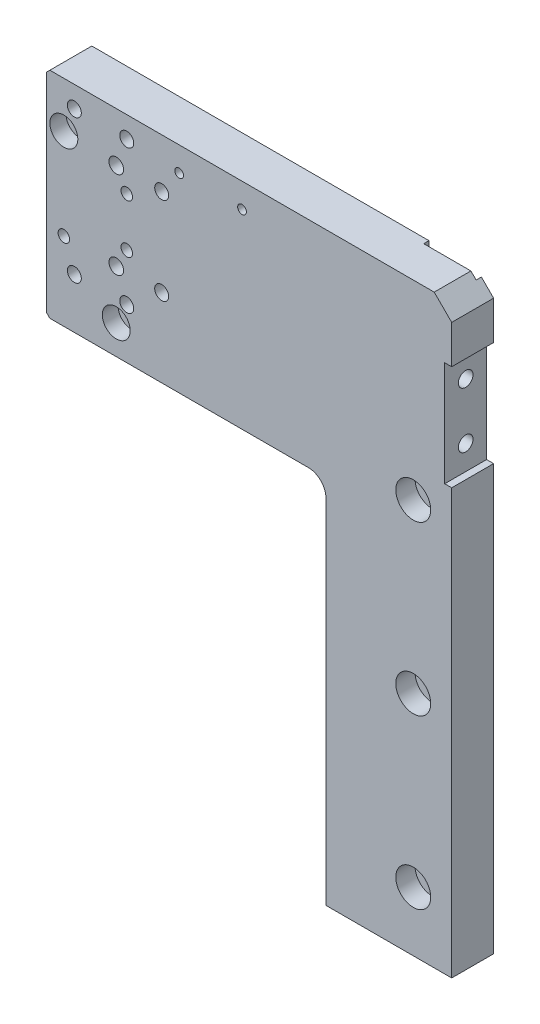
ISO-10303-21;
HEADER;
FILE_DESCRIPTION(('STEP AP214'),'2;1');
FILE_NAME('part.step','',(''),(''),'','','');
FILE_SCHEMA(('AUTOMOTIVE_DESIGN { 1 0 10303 214 1 1 1 1 }'));
ENDSEC;
DATA;
#1=APPLICATION_CONTEXT('core data for automotive mechanical design processes');
#2=APPLICATION_PROTOCOL_DEFINITION('international standard','automotive_design',2000,#1);
#3=PRODUCT_CONTEXT('',#1,'mechanical');
#4=PRODUCT('Part','Part','',(#3));
#5=PRODUCT_RELATED_PRODUCT_CATEGORY('part','',(#4));
#6=PRODUCT_DEFINITION_FORMATION('','',#4);
#7=PRODUCT_DEFINITION_CONTEXT('part definition',#1,'design');
#8=PRODUCT_DEFINITION('design','',#6,#7);
#9=PRODUCT_DEFINITION_SHAPE('','',#8);
#10=(LENGTH_UNIT() NAMED_UNIT(*) SI_UNIT(.MILLI.,.METRE.));
#11=(NAMED_UNIT(*) PLANE_ANGLE_UNIT() SI_UNIT($,.RADIAN.));
#12=(NAMED_UNIT(*) SI_UNIT($,.STERADIAN.) SOLID_ANGLE_UNIT());
#13=UNCERTAINTY_MEASURE_WITH_UNIT(LENGTH_MEASURE(1.E-05),#10,'distance_accuracy_value','');
#14=(GEOMETRIC_REPRESENTATION_CONTEXT(3) GLOBAL_UNCERTAINTY_ASSIGNED_CONTEXT((#13)) GLOBAL_UNIT_ASSIGNED_CONTEXT((#10,
#11,#12)) REPRESENTATION_CONTEXT('',''));
#15=CARTESIAN_POINT('',(0.,0.,0.));
#16=DIRECTION('',(0.,0.,1.));
#17=DIRECTION('',(1.,0.,0.));
#18=AXIS2_PLACEMENT_3D('',#15,#16,#17);
#19=CARTESIAN_POINT('',(389.720096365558,-9.64,-29.4927569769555));
#20=DIRECTION('',(0.,0.,1.));
#21=DIRECTION('',(-1.,0.,0.));
#22=AXIS2_PLACEMENT_3D('',#19,#20,#21);
#23=CYLINDRICAL_SURFACE('',#22,2.25);
#24=CARTESIAN_POINT('',(389.720096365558,-9.64,-33.9927569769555));
#25=DIRECTION('',(0.,0.,-1.));
#26=DIRECTION('',(-1.,0.,0.));
#27=AXIS2_PLACEMENT_3D('',#24,#25,#26);
#28=CIRCLE('',#27,2.25);
#29=CARTESIAN_POINT('',(387.470096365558,-9.64,-33.9927569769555));
#30=VERTEX_POINT('',#29);
#31=EDGE_CURVE('E340',#30,#30,#28,.F.);
#32=ORIENTED_EDGE('',*,*,#31,.T.);
#33=EDGE_LOOP('',(#32));
#34=FACE_BOUND('',#33,.T.);
#35=CARTESIAN_POINT('',(389.720096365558,-9.64,-39.4927569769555));
#36=DIRECTION('',(0.,0.,-1.));
#37=DIRECTION('',(-1.,0.,0.));
#38=AXIS2_PLACEMENT_3D('',#35,#36,#37);
#39=CIRCLE('',#38,2.25);
#40=CARTESIAN_POINT('',(387.470096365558,-9.64,-39.4927569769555));
#41=VERTEX_POINT('',#40);
#42=EDGE_CURVE('E370',#41,#41,#39,.F.);
#43=ORIENTED_EDGE('',*,*,#42,.F.);
#44=EDGE_LOOP('',(#43));
#45=FACE_BOUND('',#44,.T.);
#46=ADVANCED_FACE('F16',(#34,#45),#23,.F.);
#47=CARTESIAN_POINT('',(374.720096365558,30.36,-29.4927569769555));
#48=DIRECTION('',(0.,0.,1.));
#49=DIRECTION('',(1.,0.,0.));
#50=AXIS2_PLACEMENT_3D('',#47,#48,#49);
#51=CYLINDRICAL_SURFACE('',#50,2.24999999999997);
#52=CARTESIAN_POINT('',(374.720096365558,30.36,-34.0927569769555));
#53=DIRECTION('',(0.,0.,1.));
#54=DIRECTION('',(1.,0.,0.));
#55=AXIS2_PLACEMENT_3D('',#52,#53,#54);
#56=CIRCLE('',#55,2.24999999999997);
#57=CARTESIAN_POINT('',(376.970096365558,30.36,-34.0927569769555));
#58=VERTEX_POINT('',#57);
#59=EDGE_CURVE('E387',#58,#58,#56,.T.);
#60=ORIENTED_EDGE('',*,*,#59,.T.);
#61=EDGE_LOOP('',(#60));
#62=FACE_BOUND('',#61,.T.);
#63=CARTESIAN_POINT('',(374.720096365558,30.36,-39.4927569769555));
#64=DIRECTION('',(0.,0.,-1.));
#65=DIRECTION('',(-1.,0.,0.));
#66=AXIS2_PLACEMENT_3D('',#63,#64,#65);
#67=CIRCLE('',#66,2.24999999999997);
#68=CARTESIAN_POINT('',(372.470096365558,30.36,-39.4927569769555));
#69=VERTEX_POINT('',#68);
#70=EDGE_CURVE('E361',#69,#69,#67,.F.);
#71=ORIENTED_EDGE('',*,*,#70,.F.);
#72=EDGE_LOOP('',(#71));
#73=FACE_BOUND('',#72,.T.);
#74=ADVANCED_FACE('F480',(#62,#73),#51,.F.);
#75=CARTESIAN_POINT('',(460.720096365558,33.46,-29.4927569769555));
#76=DIRECTION('',(0.,0.,-1.));
#77=DIRECTION('',(1.,0.,0.));
#78=AXIS2_PLACEMENT_3D('',#75,#76,#77);
#79=PLANE('',#78);
#80=CARTESIAN_POINT('',(392.720096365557,9.86,-29.4927569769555));
#81=DIRECTION('',(0.,0.,-1.));
#82=DIRECTION('',(-1.,0.,0.));
#83=AXIS2_PLACEMENT_3D('',#80,#81,#82);
#84=CIRCLE('',#83,1.65);
#85=CARTESIAN_POINT('',(391.070096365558,9.86,-29.4927569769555));
#86=VERTEX_POINT('',#85);
#87=EDGE_CURVE('E393',#86,#86,#84,.T.);
#88=ORIENTED_EDGE('',*,*,#87,.T.);
#89=EDGE_LOOP('',(#88));
#90=FACE_BOUND('',#89,.T.);
#91=CARTESIAN_POINT('',(392.720096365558,23.86,-29.4927569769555));
#92=DIRECTION('',(0.,0.,-1.));
#93=DIRECTION('',(-1.,0.,0.));
#94=AXIS2_PLACEMENT_3D('',#91,#92,#93);
#95=CIRCLE('',#94,1.65);
#96=CARTESIAN_POINT('',(391.070096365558,23.86,-29.4927569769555));
#97=VERTEX_POINT('',#96);
#98=EDGE_CURVE('E399',#97,#97,#95,.T.);
#99=ORIENTED_EDGE('',*,*,#98,.T.);
#100=EDGE_LOOP('',(#99));
#101=FACE_BOUND('',#100,.T.);
#102=CARTESIAN_POINT('',(392.720096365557,37.36,-29.4927569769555));
#103=DIRECTION('',(0.,0.,1.));
#104=DIRECTION('',(1.,0.,0.));
#105=AXIS2_PLACEMENT_3D('',#102,#103,#104);
#106=CIRCLE('',#105,2.);
#107=CARTESIAN_POINT('',(394.720096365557,37.36,-29.4927569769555));
#108=VERTEX_POINT('',#107);
#109=EDGE_CURVE('E428',#108,#108,#106,.T.);
#110=ORIENTED_EDGE('',*,*,#109,.F.);
#111=EDGE_LOOP('',(#110));
#112=FACE_BOUND('',#111,.T.);
#113=CARTESIAN_POINT('',(377.720096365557,37.36,-29.4927569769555));
#114=DIRECTION('',(0.,0.,1.));
#115=DIRECTION('',(1.,0.,0.));
#116=AXIS2_PLACEMENT_3D('',#113,#114,#115);
#117=CIRCLE('',#116,2.);
#118=CARTESIAN_POINT('',(379.720096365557,37.36,-29.4927569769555));
#119=VERTEX_POINT('',#118);
#120=EDGE_CURVE('E434',#119,#119,#117,.T.);
#121=ORIENTED_EDGE('',*,*,#120,.F.);
#122=EDGE_LOOP('',(#121));
#123=FACE_BOUND('',#122,.T.);
#124=CARTESIAN_POINT('',(377.720096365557,-3.64,-29.4927569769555));
#125=DIRECTION('',(0.,0.,1.));
#126=DIRECTION('',(1.,0.,0.));
#127=AXIS2_PLACEMENT_3D('',#124,#125,#126);
#128=CIRCLE('',#127,2.);
#129=CARTESIAN_POINT('',(379.720096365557,-3.64,-29.4927569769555));
#130=VERTEX_POINT('',#129);
#131=EDGE_CURVE('E440',#130,#130,#128,.T.);
#132=ORIENTED_EDGE('',*,*,#131,.F.);
#133=EDGE_LOOP('',(#132));
#134=FACE_BOUND('',#133,.T.);
#135=CARTESIAN_POINT('',(392.720096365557,-3.64,-29.4927569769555));
#136=DIRECTION('',(0.,0.,1.));
#137=DIRECTION('',(1.,0.,0.));
#138=AXIS2_PLACEMENT_3D('',#135,#136,#137);
#139=CIRCLE('',#138,2.);
#140=CARTESIAN_POINT('',(394.720096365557,-3.64,-29.4927569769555));
#141=VERTEX_POINT('',#140);
#142=EDGE_CURVE('E186',#141,#141,#139,.T.);
#143=ORIENTED_EDGE('',*,*,#142,.F.);
#144=EDGE_LOOP('',(#143));
#145=FACE_BOUND('',#144,.T.);
#146=CARTESIAN_POINT('',(402.720096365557,4.36,-29.4927569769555));
#147=DIRECTION('',(0.,0.,1.));
#148=DIRECTION('',(1.,0.,0.));
#149=AXIS2_PLACEMENT_3D('',#146,#147,#148);
#150=CIRCLE('',#149,2.);
#151=CARTESIAN_POINT('',(404.720096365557,4.36,-29.4927569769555));
#152=VERTEX_POINT('',#151);
#153=EDGE_CURVE('E185',#152,#152,#150,.T.);
#154=ORIENTED_EDGE('',*,*,#153,.F.);
#155=EDGE_LOOP('',(#154));
#156=FACE_BOUND('',#155,.T.);
#157=CARTESIAN_POINT('',(402.720096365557,29.36,-29.4927569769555));
#158=DIRECTION('',(0.,0.,1.));
#159=DIRECTION('',(1.,0.,0.));
#160=AXIS2_PLACEMENT_3D('',#157,#158,#159);
#161=CIRCLE('',#160,2.);
#162=CARTESIAN_POINT('',(404.720096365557,29.36,-29.4927569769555));
#163=VERTEX_POINT('',#162);
#164=EDGE_CURVE('E198',#163,#163,#161,.T.);
#165=ORIENTED_EDGE('',*,*,#164,.F.);
#166=EDGE_LOOP('',(#165));
#167=FACE_BOUND('',#166,.T.);
#168=CARTESIAN_POINT('',(374.720096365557,4.36,-29.4927569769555));
#169=DIRECTION('',(0.,0.,1.));
#170=DIRECTION('',(1.,0.,0.));
#171=AXIS2_PLACEMENT_3D('',#168,#169,#170);
#172=CIRCLE('',#171,1.65);
#173=CARTESIAN_POINT('',(376.370096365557,4.36,-29.4927569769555));
#174=VERTEX_POINT('',#173);
#175=EDGE_CURVE('E224',#174,#174,#172,.T.);
#176=ORIENTED_EDGE('',*,*,#175,.F.);
#177=EDGE_LOOP('',(#176));
#178=FACE_BOUND('',#177,.T.);
#179=CARTESIAN_POINT('',(389.720096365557,4.36,-29.4927569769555));
#180=DIRECTION('',(0.,0.,1.));
#181=DIRECTION('',(1.,0.,0.));
#182=AXIS2_PLACEMENT_3D('',#179,#180,#181);
#183=CIRCLE('',#182,2.1);
#184=CARTESIAN_POINT('',(391.820096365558,4.36,-29.4927569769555));
#185=VERTEX_POINT('',#184);
#186=EDGE_CURVE('E230',#185,#185,#183,.T.);
#187=ORIENTED_EDGE('',*,*,#186,.F.);
#188=EDGE_LOOP('',(#187));
#189=FACE_BOUND('',#188,.T.);
#190=CARTESIAN_POINT('',(389.720096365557,29.36,-29.4927569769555));
#191=DIRECTION('',(0.,0.,1.));
#192=DIRECTION('',(1.,0.,0.));
#193=AXIS2_PLACEMENT_3D('',#190,#191,#192);
#194=CIRCLE('',#193,2.1);
#195=CARTESIAN_POINT('',(391.820096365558,29.36,-29.4927569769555));
#196=VERTEX_POINT('',#195);
#197=EDGE_CURVE('E236',#196,#196,#194,.T.);
#198=ORIENTED_EDGE('',*,*,#197,.F.);
#199=EDGE_LOOP('',(#198));
#200=FACE_BOUND('',#199,.T.);
#201=CARTESIAN_POINT('',(407.720096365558,36.46,-29.4927569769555));
#202=DIRECTION('',(0.,0.,1.));
#203=DIRECTION('',(1.,0.,0.));
#204=AXIS2_PLACEMENT_3D('',#201,#202,#203);
#205=CIRCLE('',#204,1.24999999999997);
#206=CARTESIAN_POINT('',(408.970096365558,36.46,-29.4927569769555));
#207=VERTEX_POINT('',#206);
#208=EDGE_CURVE('E240',#207,#207,#205,.T.);
#209=ORIENTED_EDGE('',*,*,#208,.F.);
#210=EDGE_LOOP('',(#209));
#211=FACE_BOUND('',#210,.T.);
#212=CARTESIAN_POINT('',(389.720096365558,-9.64,-29.4927569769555));
#213=DIRECTION('',(0.,0.,-1.));
#214=DIRECTION('',(-1.,0.,0.));
#215=AXIS2_PLACEMENT_3D('',#212,#213,#214);
#216=CIRCLE('',#215,4.);
#217=CARTESIAN_POINT('',(385.720096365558,-9.64,-29.4927569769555));
#218=VERTEX_POINT('',#217);
#219=EDGE_CURVE('E260',#218,#218,#216,.T.);
#220=ORIENTED_EDGE('',*,*,#219,.T.);
#221=EDGE_LOOP('',(#220));
#222=FACE_BOUND('',#221,.T.);
#223=DIRECTION('',(0.,1.,0.));
#224=VECTOR('',#223,1.);
#225=CARTESIAN_POINT('',(485.720096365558,33.46,-29.4927569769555));
#226=LINE('',#225,#224);
#227=CARTESIAN_POINT('',(485.720096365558,-124.040000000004,-29.4927569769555));
#228=VERTEX_POINT('',#227);
#229=CARTESIAN_POINT('',(485.720096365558,-2.54,-29.4927569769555));
#230=VERTEX_POINT('',#229);
#231=EDGE_CURVE('E749',#228,#230,#226,.T.);
#232=ORIENTED_EDGE('',*,*,#231,.T.);
#233=DIRECTION('',(1.,0.,0.));
#234=VECTOR('',#233,1.);
#235=CARTESIAN_POINT('',(485.720096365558,-2.54,-29.4927569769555));
#236=LINE('',#235,#234);
#237=CARTESIAN_POINT('',(483.720096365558,-2.54,-29.4927569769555));
#238=VERTEX_POINT('',#237);
#239=EDGE_CURVE('E418',#238,#230,#236,.T.);
#240=ORIENTED_EDGE('',*,*,#239,.F.);
#241=DIRECTION('',(0.,-1.,0.));
#242=VECTOR('',#241,1.);
#243=CARTESIAN_POINT('',(483.720096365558,27.46,-29.4927569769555));
#244=LINE('',#243,#242);
#245=CARTESIAN_POINT('',(483.720096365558,27.46,-29.4927569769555));
#246=VERTEX_POINT('',#245);
#247=EDGE_CURVE('E415',#246,#238,#244,.T.);
#248=ORIENTED_EDGE('',*,*,#247,.F.);
#249=DIRECTION('',(-1.,0.,0.));
#250=VECTOR('',#249,1.);
#251=CARTESIAN_POINT('',(485.720096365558,27.46,-29.4927569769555));
#252=LINE('',#251,#250);
#253=CARTESIAN_POINT('',(485.720096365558,27.46,-29.4927569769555));
#254=VERTEX_POINT('',#253);
#255=EDGE_CURVE('E412',#254,#246,#252,.T.);
#256=ORIENTED_EDGE('',*,*,#255,.F.);
#257=CARTESIAN_POINT('',(485.720096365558,38.46,-29.4927569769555));
#258=VERTEX_POINT('',#257);
#259=EDGE_CURVE('E751',#254,#258,#226,.T.);
#260=ORIENTED_EDGE('',*,*,#259,.T.);
#261=DIRECTION('',(-0.707106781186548,0.707106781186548,0.));
#262=VECTOR('',#261,1.);
#263=CARTESIAN_POINT('',(480.720096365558,43.46,-29.4927569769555));
#264=LINE('',#263,#262);
#265=CARTESIAN_POINT('',(480.720096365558,43.46,-29.4927569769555));
#266=VERTEX_POINT('',#265);
#267=EDGE_CURVE('E561',#258,#266,#264,.T.);
#268=ORIENTED_EDGE('',*,*,#267,.T.);
#269=DIRECTION('',(1.,0.,0.));
#270=VECTOR('',#269,1.);
#271=CARTESIAN_POINT('',(460.720096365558,43.46,-29.4927569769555));
#272=LINE('',#271,#270);
#273=CARTESIAN_POINT('',(370.720096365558,43.46,-29.4927569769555));
#274=VERTEX_POINT('',#273);
#275=EDGE_CURVE('E270',#266,#274,#272,.F.);
#276=ORIENTED_EDGE('',*,*,#275,.T.);
#277=DIRECTION('',(-0.707106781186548,-0.707106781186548,0.));
#278=VECTOR('',#277,1.);
#279=CARTESIAN_POINT('',(370.220096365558,42.96,-29.4927569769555));
#280=LINE('',#279,#278);
#281=CARTESIAN_POINT('',(369.720096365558,42.46,-29.4927569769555));
#282=VERTEX_POINT('',#281);
#283=EDGE_CURVE('E335',#274,#282,#280,.T.);
#284=ORIENTED_EDGE('',*,*,#283,.T.);
#285=DIRECTION('',(0.,1.,0.));
#286=VECTOR('',#285,1.);
#287=CARTESIAN_POINT('',(369.720096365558,33.46,-29.4927569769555));
#288=LINE('',#287,#286);
#289=CARTESIAN_POINT('',(369.720096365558,-17.04,-29.4927569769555));
#290=VERTEX_POINT('',#289);
#291=EDGE_CURVE('E267',#282,#290,#288,.F.);
#292=ORIENTED_EDGE('',*,*,#291,.T.);
#293=DIRECTION('',(0.707106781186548,-0.707106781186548,0.));
#294=VECTOR('',#293,1.);
#295=CARTESIAN_POINT('',(370.220096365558,-17.54,-29.4927569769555));
#296=LINE('',#295,#294);
#297=CARTESIAN_POINT('',(370.720096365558,-18.04,-29.4927569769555));
#298=VERTEX_POINT('',#297);
#299=EDGE_CURVE('E320',#290,#298,#296,.T.);
#300=ORIENTED_EDGE('',*,*,#299,.T.);
#301=DIRECTION('',(1.,0.,0.));
#302=VECTOR('',#301,1.);
#303=CARTESIAN_POINT('',(460.720096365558,-18.04,-29.4927569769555));
#304=LINE('',#303,#302);
#305=CARTESIAN_POINT('',(444.720096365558,-18.04,-29.4927569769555));
#306=VERTEX_POINT('',#305);
#307=EDGE_CURVE('E264',#298,#306,#304,.T.);
#308=ORIENTED_EDGE('',*,*,#307,.T.);
#309=CARTESIAN_POINT('',(444.720096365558,-23.04,-29.4927569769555));
#310=DIRECTION('',(0.,0.,-1.));
#311=DIRECTION('',(-1.,0.,0.));
#312=AXIS2_PLACEMENT_3D('',#309,#310,#311);
#313=CIRCLE('',#312,5.);
#314=CARTESIAN_POINT('',(449.720096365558,-23.04,-29.4927569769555));
#315=VERTEX_POINT('',#314);
#316=EDGE_CURVE('E261',#306,#315,#313,.T.);
#317=ORIENTED_EDGE('',*,*,#316,.T.);
#318=DIRECTION('',(0.,1.,0.));
#319=VECTOR('',#318,1.);
#320=CARTESIAN_POINT('',(449.720096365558,33.46,-29.4927569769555));
#321=LINE('',#320,#319);
#322=CARTESIAN_POINT('',(449.720096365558,-124.040000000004,-29.4927569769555));
#323=VERTEX_POINT('',#322);
#324=EDGE_CURVE('E257',#315,#323,#321,.F.);
#325=ORIENTED_EDGE('',*,*,#324,.T.);
#326=DIRECTION('',(1.,0.,0.));
#327=VECTOR('',#326,1.);
#328=CARTESIAN_POINT('',(369.719993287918,-124.040000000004,-29.4927569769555));
#329=LINE('',#328,#327);
#330=EDGE_CURVE('E207',#323,#228,#329,.T.);
#331=ORIENTED_EDGE('',*,*,#330,.T.);
#332=EDGE_LOOP('',(#232,#240,#248,#256,#260,#268,#276,#284,#292,#300,#308,#317,#325,#331));
#333=FACE_BOUND('',#332,.T.);
#334=CARTESIAN_POINT('',(474.720096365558,-11.04,-29.4927569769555));
#335=DIRECTION('',(0.,0.,-1.));
#336=DIRECTION('',(-1.,0.,0.));
#337=AXIS2_PLACEMENT_3D('',#334,#335,#336);
#338=CIRCLE('',#337,5.);
#339=CARTESIAN_POINT('',(469.720096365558,-11.04,-29.4927569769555));
#340=VERTEX_POINT('',#339);
#341=EDGE_CURVE('E272',#340,#340,#338,.T.);
#342=ORIENTED_EDGE('',*,*,#341,.T.);
#343=EDGE_LOOP('',(#342));
#344=FACE_BOUND('',#343,.T.);
#345=CARTESIAN_POINT('',(474.720096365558,-59.04,-29.4927569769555));
#346=DIRECTION('',(0.,0.,-1.));
#347=DIRECTION('',(-1.,0.,0.));
#348=AXIS2_PLACEMENT_3D('',#345,#346,#347);
#349=CIRCLE('',#348,5.);
#350=CARTESIAN_POINT('',(469.720096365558,-59.04,-29.4927569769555));
#351=VERTEX_POINT('',#350);
#352=EDGE_CURVE('E770',#351,#351,#349,.T.);
#353=ORIENTED_EDGE('',*,*,#352,.T.);
#354=EDGE_LOOP('',(#353));
#355=FACE_BOUND('',#354,.T.);
#356=CARTESIAN_POINT('',(474.720096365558,-107.04,-29.4927569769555));
#357=DIRECTION('',(0.,0.,-1.));
#358=DIRECTION('',(-1.,0.,0.));
#359=AXIS2_PLACEMENT_3D('',#356,#357,#358);
#360=CIRCLE('',#359,5.);
#361=CARTESIAN_POINT('',(469.720096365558,-107.04,-29.4927569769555));
#362=VERTEX_POINT('',#361);
#363=EDGE_CURVE('E773',#362,#362,#360,.T.);
#364=ORIENTED_EDGE('',*,*,#363,.T.);
#365=EDGE_LOOP('',(#364));
#366=FACE_BOUND('',#365,.T.);
#367=CARTESIAN_POINT('',(425.720096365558,36.46,-29.4927569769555));
#368=DIRECTION('',(0.,0.,1.));
#369=DIRECTION('',(1.,0.,0.));
#370=AXIS2_PLACEMENT_3D('',#367,#368,#369);
#371=CIRCLE('',#370,1.24999999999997);
#372=CARTESIAN_POINT('',(426.970096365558,36.46,-29.4927569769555));
#373=VERTEX_POINT('',#372);
#374=EDGE_CURVE('E246',#373,#373,#371,.T.);
#375=ORIENTED_EDGE('',*,*,#374,.F.);
#376=EDGE_LOOP('',(#375));
#377=FACE_BOUND('',#376,.T.);
#378=CARTESIAN_POINT('',(374.720096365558,30.36,-29.4927569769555));
#379=DIRECTION('',(0.,0.,1.));
#380=DIRECTION('',(1.,0.,0.));
#381=AXIS2_PLACEMENT_3D('',#378,#379,#380);
#382=CIRCLE('',#381,4.);
#383=CARTESIAN_POINT('',(378.720096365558,30.36,-29.4927569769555));
#384=VERTEX_POINT('',#383);
#385=EDGE_CURVE('E381',#384,#384,#382,.T.);
#386=ORIENTED_EDGE('',*,*,#385,.F.);
#387=EDGE_LOOP('',(#386));
#388=FACE_BOUND('',#387,.T.);
#389=ADVANCED_FACE('F476',(#90,#101,#112,#123,#134,#145,#156,#167,#178,#189,#200,#211,#222,#333,
#344,#355,#366,#377,#388),#79,.F.);
#390=CARTESIAN_POINT('',(485.720096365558,43.46,-29.4926538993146));
#391=DIRECTION('',(-1.,0.,0.));
#392=DIRECTION('',(0.,0.,1.));
#393=AXIS2_PLACEMENT_3D('',#390,#391,#392);
#394=PLANE('',#393);
#395=DIRECTION('',(0.,1.,0.));
#396=VECTOR('',#395,1.);
#397=CARTESIAN_POINT('',(485.720096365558,43.46,-41.4927569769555));
#398=LINE('',#397,#396);
#399=CARTESIAN_POINT('',(485.720096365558,-124.040000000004,-41.4927569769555));
#400=VERTEX_POINT('',#399);
#401=CARTESIAN_POINT('',(485.720096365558,-2.54,-41.4927569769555));
#402=VERTEX_POINT('',#401);
#403=EDGE_CURVE('E253',#400,#402,#398,.T.);
#404=ORIENTED_EDGE('',*,*,#403,.T.);
#405=DIRECTION('',(0.,0.,1.));
#406=VECTOR('',#405,1.);
#407=CARTESIAN_POINT('',(485.720096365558,-2.54,-29.4926538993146));
#408=LINE('',#407,#406);
#409=EDGE_CURVE('E568',#402,#230,#408,.T.);
#410=ORIENTED_EDGE('',*,*,#409,.T.);
#411=ORIENTED_EDGE('',*,*,#231,.F.);
#412=DIRECTION('',(0.,0.,1.));
#413=VECTOR('',#412,1.);
#414=CARTESIAN_POINT('',(485.720096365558,-124.040000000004,-29.4927569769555));
#415=LINE('',#414,#413);
#416=EDGE_CURVE('E204',#400,#228,#415,.T.);
#417=ORIENTED_EDGE('',*,*,#416,.F.);
#418=EDGE_LOOP('',(#404,#410,#411,#417));
#419=FACE_BOUND('',#418,.T.);
#420=ADVANCED_FACE('F479',(#419),#394,.F.);
#421=CARTESIAN_POINT('',(482.220096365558,61.7100024,-57.49));
#422=DIRECTION('',(1.,0.,0.));
#423=DIRECTION('',(0.,0.,1.));
#424=AXIS2_PLACEMENT_3D('',#421,#422,#423);
#425=PLANE('',#424);
#426=DIRECTION('',(0.,1.,0.));
#427=VECTOR('',#426,1.);
#428=CARTESIAN_POINT('',(482.220096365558,61.7100024,-39.9927569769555));
#429=LINE('',#428,#427);
#430=CARTESIAN_POINT('',(482.220096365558,41.96,-39.9927569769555));
#431=VERTEX_POINT('',#430);
#432=CARTESIAN_POINT('',(482.220096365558,-124.040000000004,-39.9927569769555));
#433=VERTEX_POINT('',#432);
#434=EDGE_CURVE('E309',#431,#433,#429,.F.);
#435=ORIENTED_EDGE('',*,*,#434,.F.);
#436=DIRECTION('',(0.,0.,-1.));
#437=VECTOR('',#436,1.);
#438=CARTESIAN_POINT('',(482.220096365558,41.96,-29.4927569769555));
#439=LINE('',#438,#437);
#440=CARTESIAN_POINT('',(482.220096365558,41.96,-41.4927569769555));
#441=VERTEX_POINT('',#440);
#442=EDGE_CURVE('E317',#431,#441,#439,.T.);
#443=ORIENTED_EDGE('',*,*,#442,.T.);
#444=DIRECTION('',(0.,1.,0.));
#445=VECTOR('',#444,1.);
#446=CARTESIAN_POINT('',(482.220096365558,33.46,-41.4927569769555));
#447=LINE('',#446,#445);
#448=CARTESIAN_POINT('',(482.220096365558,-124.040000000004,-41.4927569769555));
#449=VERTEX_POINT('',#448);
#450=EDGE_CURVE('E318',#441,#449,#447,.F.);
#451=ORIENTED_EDGE('',*,*,#450,.T.);
#452=DIRECTION('',(0.,0.,1.));
#453=VECTOR('',#452,1.);
#454=CARTESIAN_POINT('',(482.220096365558,-124.040000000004,-57.49));
#455=LINE('',#454,#453);
#456=EDGE_CURVE('E221',#449,#433,#455,.T.);
#457=ORIENTED_EDGE('',*,*,#456,.T.);
#458=EDGE_LOOP('',(#435,#443,#451,#457));
#459=FACE_BOUND('',#458,.T.);
#460=ADVANCED_FACE('F533',(#459),#425,.F.);
#461=CARTESIAN_POINT('',(474.720096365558,-59.04,-42.6927593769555));
#462=DIRECTION('',(0.,0.,1.));
#463=DIRECTION('',(0.,1.,0.));
#464=AXIS2_PLACEMENT_3D('',#461,#462,#463);
#465=CYLINDRICAL_SURFACE('',#464,2.75);
#466=CARTESIAN_POINT('',(474.720096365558,-59.04,-34.9927569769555));
#467=DIRECTION('',(0.,0.,-1.));
#468=DIRECTION('',(0.,1.,0.));
#469=AXIS2_PLACEMENT_3D('',#466,#467,#468);
#470=CIRCLE('',#469,2.75);
#471=CARTESIAN_POINT('',(474.720096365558,-56.29,-34.9927569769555));
#472=VERTEX_POINT('',#471);
#473=EDGE_CURVE('E723',#472,#472,#470,.F.);
#474=ORIENTED_EDGE('',*,*,#473,.T.);
#475=EDGE_LOOP('',(#474));
#476=FACE_BOUND('',#475,.T.);
#477=CARTESIAN_POINT('',(474.720096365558,-59.04,-39.9927569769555));
#478=DIRECTION('',(0.,0.,-1.));
#479=DIRECTION('',(0.,1.,0.));
#480=AXIS2_PLACEMENT_3D('',#477,#478,#479);
#481=CIRCLE('',#480,2.75);
#482=CARTESIAN_POINT('',(474.720096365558,-56.29,-39.9927569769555));
#483=VERTEX_POINT('',#482);
#484=EDGE_CURVE('E312',#483,#483,#481,.F.);
#485=ORIENTED_EDGE('',*,*,#484,.F.);
#486=EDGE_LOOP('',(#485));
#487=FACE_BOUND('',#486,.T.);
#488=ADVANCED_FACE('F530',(#476,#487),#465,.F.);
#489=CARTESIAN_POINT('',(474.720096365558,-11.04,-42.6927593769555));
#490=DIRECTION('',(0.,0.,1.));
#491=DIRECTION('',(0.,1.,0.));
#492=AXIS2_PLACEMENT_3D('',#489,#490,#491);
#493=CYLINDRICAL_SURFACE('',#492,2.75);
#494=CARTESIAN_POINT('',(474.720096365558,-11.04,-34.9927569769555));
#495=DIRECTION('',(0.,0.,-1.));
#496=DIRECTION('',(0.,1.,0.));
#497=AXIS2_PLACEMENT_3D('',#494,#495,#496);
#498=CIRCLE('',#497,2.75);
#499=CARTESIAN_POINT('',(474.720096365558,-8.29,-34.9927569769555));
#500=VERTEX_POINT('',#499);
#501=EDGE_CURVE('E345',#500,#500,#498,.F.);
#502=ORIENTED_EDGE('',*,*,#501,.T.);
#503=EDGE_LOOP('',(#502));
#504=FACE_BOUND('',#503,.T.);
#505=CARTESIAN_POINT('',(474.720096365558,-11.04,-39.9927569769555));
#506=DIRECTION('',(0.,0.,-1.));
#507=DIRECTION('',(0.,1.,0.));
#508=AXIS2_PLACEMENT_3D('',#505,#506,#507);
#509=CIRCLE('',#508,2.75);
#510=CARTESIAN_POINT('',(474.720096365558,-8.29,-39.9927569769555));
#511=VERTEX_POINT('',#510);
#512=EDGE_CURVE('E738',#511,#511,#509,.F.);
#513=ORIENTED_EDGE('',*,*,#512,.F.);
#514=EDGE_LOOP('',(#513));
#515=FACE_BOUND('',#514,.T.);
#516=ADVANCED_FACE('F526',(#504,#515),#493,.F.);
#517=CARTESIAN_POINT('',(474.720096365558,-107.04,-42.6927593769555));
#518=DIRECTION('',(0.,0.,1.));
#519=DIRECTION('',(0.,1.,0.));
#520=AXIS2_PLACEMENT_3D('',#517,#518,#519);
#521=CYLINDRICAL_SURFACE('',#520,2.75);
#522=CARTESIAN_POINT('',(474.720096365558,-107.04,-34.9927569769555));
#523=DIRECTION('',(0.,0.,-1.));
#524=DIRECTION('',(0.,1.,0.));
#525=AXIS2_PLACEMENT_3D('',#522,#523,#524);
#526=CIRCLE('',#525,2.75);
#527=CARTESIAN_POINT('',(474.720096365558,-104.29,-34.9927569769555));
#528=VERTEX_POINT('',#527);
#529=EDGE_CURVE('E746',#528,#528,#526,.F.);
#530=ORIENTED_EDGE('',*,*,#529,.T.);
#531=EDGE_LOOP('',(#530));
#532=FACE_BOUND('',#531,.T.);
#533=CARTESIAN_POINT('',(474.720096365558,-107.04,-39.9927569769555));
#534=DIRECTION('',(0.,0.,-1.));
#535=DIRECTION('',(0.,1.,0.));
#536=AXIS2_PLACEMENT_3D('',#533,#534,#535);
#537=CIRCLE('',#536,2.75);
#538=CARTESIAN_POINT('',(474.720096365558,-104.29,-39.9927569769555));
#539=VERTEX_POINT('',#538);
#540=EDGE_CURVE('E303',#539,#539,#537,.F.);
#541=ORIENTED_EDGE('',*,*,#540,.F.);
#542=EDGE_LOOP('',(#541));
#543=FACE_BOUND('',#542,.T.);
#544=ADVANCED_FACE('F522',(#532,#543),#521,.F.);
#545=CARTESIAN_POINT('',(467.220096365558,61.7100024,-39.9927569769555));
#546=DIRECTION('',(-1.,0.,0.));
#547=DIRECTION('',(0.,0.,-1.));
#548=AXIS2_PLACEMENT_3D('',#545,#546,#547);
#549=PLANE('',#548);
#550=DIRECTION('',(0.,1.,0.));
#551=VECTOR('',#550,1.);
#552=CARTESIAN_POINT('',(467.220096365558,61.7100024,-39.9927569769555));
#553=LINE('',#552,#551);
#554=CARTESIAN_POINT('',(467.220096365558,-124.040000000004,-39.9927569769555));
#555=VERTEX_POINT('',#554);
#556=CARTESIAN_POINT('',(467.220096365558,43.46,-39.9927569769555));
#557=VERTEX_POINT('',#556);
#558=EDGE_CURVE('E306',#555,#557,#553,.T.);
#559=ORIENTED_EDGE('',*,*,#558,.F.);
#560=DIRECTION('',(0.,0.,-1.));
#561=VECTOR('',#560,1.);
#562=CARTESIAN_POINT('',(467.220096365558,-124.040000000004,-39.9927569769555));
#563=LINE('',#562,#561);
#564=CARTESIAN_POINT('',(467.220096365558,-124.040000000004,-41.4927569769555));
#565=VERTEX_POINT('',#564);
#566=EDGE_CURVE('E218',#555,#565,#563,.T.);
#567=ORIENTED_EDGE('',*,*,#566,.T.);
#568=DIRECTION('',(0.,1.,0.));
#569=VECTOR('',#568,1.);
#570=CARTESIAN_POINT('',(467.220096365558,33.46,-41.4927569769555));
#571=LINE('',#570,#569);
#572=CARTESIAN_POINT('',(467.220096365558,43.46,-41.4927569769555));
#573=VERTEX_POINT('',#572);
#574=EDGE_CURVE('E301',#565,#573,#571,.T.);
#575=ORIENTED_EDGE('',*,*,#574,.T.);
#576=DIRECTION('',(0.,0.,-1.));
#577=VECTOR('',#576,1.);
#578=CARTESIAN_POINT('',(467.220096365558,43.46,-39.9927569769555));
#579=LINE('',#578,#577);
#580=EDGE_CURVE('E256',#573,#557,#579,.F.);
#581=ORIENTED_EDGE('',*,*,#580,.T.);
#582=EDGE_LOOP('',(#559,#567,#575,#581));
#583=FACE_BOUND('',#582,.T.);
#584=ADVANCED_FACE('F519',(#583),#549,.F.);
#585=CARTESIAN_POINT('',(474.720096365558,-47.79,-34.9927569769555));
#586=DIRECTION('',(0.,0.,1.));
#587=DIRECTION('',(-1.,0.,0.));
#588=AXIS2_PLACEMENT_3D('',#585,#586,#587);
#589=PLANE('',#588);
#590=ORIENTED_EDGE('',*,*,#529,.F.);
#591=EDGE_LOOP('',(#590));
#592=FACE_BOUND('',#591,.T.);
#593=CARTESIAN_POINT('',(474.720096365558,-107.04,-34.9927569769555));
#594=DIRECTION('',(0.,0.,-1.));
#595=DIRECTION('',(-1.,0.,0.));
#596=AXIS2_PLACEMENT_3D('',#593,#594,#595);
#597=CIRCLE('',#596,5.);
#598=CARTESIAN_POINT('',(469.720096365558,-107.04,-34.9927569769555));
#599=VERTEX_POINT('',#598);
#600=EDGE_CURVE('E727',#599,#599,#597,.T.);
#601=ORIENTED_EDGE('',*,*,#600,.F.);
#602=EDGE_LOOP('',(#601));
#603=FACE_BOUND('',#602,.T.);
#604=ADVANCED_FACE('F517',(#592,#603),#589,.T.);
#605=CARTESIAN_POINT('',(474.720096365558,-47.79,-34.9927569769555));
#606=DIRECTION('',(0.,0.,1.));
#607=DIRECTION('',(-1.,0.,0.));
#608=AXIS2_PLACEMENT_3D('',#605,#606,#607);
#609=PLANE('',#608);
#610=ORIENTED_EDGE('',*,*,#473,.F.);
#611=EDGE_LOOP('',(#610));
#612=FACE_BOUND('',#611,.T.);
#613=CARTESIAN_POINT('',(474.720096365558,-59.04,-34.9927569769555));
#614=DIRECTION('',(0.,0.,-1.));
#615=DIRECTION('',(-1.,0.,0.));
#616=AXIS2_PLACEMENT_3D('',#613,#614,#615);
#617=CIRCLE('',#616,5.);
#618=CARTESIAN_POINT('',(469.720096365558,-59.04,-34.9927569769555));
#619=VERTEX_POINT('',#618);
#620=EDGE_CURVE('E726',#619,#619,#617,.T.);
#621=ORIENTED_EDGE('',*,*,#620,.F.);
#622=EDGE_LOOP('',(#621));
#623=FACE_BOUND('',#622,.T.);
#624=ADVANCED_FACE('F711',(#612,#623),#609,.T.);
#625=CARTESIAN_POINT('',(474.720096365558,-47.79,-34.9927569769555));
#626=DIRECTION('',(0.,0.,1.));
#627=DIRECTION('',(-1.,0.,0.));
#628=AXIS2_PLACEMENT_3D('',#625,#626,#627);
#629=PLANE('',#628);
#630=ORIENTED_EDGE('',*,*,#501,.F.);
#631=EDGE_LOOP('',(#630));
#632=FACE_BOUND('',#631,.T.);
#633=CARTESIAN_POINT('',(474.720096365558,-11.04,-34.9927569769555));
#634=DIRECTION('',(0.,0.,-1.));
#635=DIRECTION('',(-1.,0.,0.));
#636=AXIS2_PLACEMENT_3D('',#633,#634,#635);
#637=CIRCLE('',#636,5.);
#638=CARTESIAN_POINT('',(469.720096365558,-11.04,-34.9927569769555));
#639=VERTEX_POINT('',#638);
#640=EDGE_CURVE('E296',#639,#639,#637,.T.);
#641=ORIENTED_EDGE('',*,*,#640,.F.);
#642=EDGE_LOOP('',(#641));
#643=FACE_BOUND('',#642,.T.);
#644=ADVANCED_FACE('F708',(#632,#643),#629,.T.);
#645=CARTESIAN_POINT('',(370.220096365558,42.96,-35.4927569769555));
#646=DIRECTION('',(-0.707106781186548,0.707106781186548,0.));
#647=DIRECTION('',(-0.707106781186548,-0.707106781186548,0.));
#648=AXIS2_PLACEMENT_3D('',#645,#646,#647);
#649=PLANE('',#648);
#650=DIRECTION('',(0.,0.,-1.));
#651=VECTOR('',#650,1.);
#652=CARTESIAN_POINT('',(369.720096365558,42.46,-29.4927569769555));
#653=LINE('',#652,#651);
#654=CARTESIAN_POINT('',(369.720096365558,42.46,-41.4927569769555));
#655=VERTEX_POINT('',#654);
#656=EDGE_CURVE('E285',#655,#282,#653,.F.);
#657=ORIENTED_EDGE('',*,*,#656,.T.);
#658=ORIENTED_EDGE('',*,*,#283,.F.);
#659=DIRECTION('',(0.,0.,-1.));
#660=VECTOR('',#659,1.);
#661=CARTESIAN_POINT('',(370.720096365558,43.46,-29.4927569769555));
#662=LINE('',#661,#660);
#663=CARTESIAN_POINT('',(370.720096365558,43.46,-41.4927569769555));
#664=VERTEX_POINT('',#663);
#665=EDGE_CURVE('E293',#274,#664,#662,.T.);
#666=ORIENTED_EDGE('',*,*,#665,.T.);
#667=DIRECTION('',(-0.70710678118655,-0.707106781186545,0.));
#668=VECTOR('',#667,1.);
#669=CARTESIAN_POINT('',(370.720096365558,43.46,-41.4927569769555));
#670=LINE('',#669,#668);
#671=EDGE_CURVE('E297',#664,#655,#670,.T.);
#672=ORIENTED_EDGE('',*,*,#671,.T.);
#673=EDGE_LOOP('',(#657,#658,#666,#672));
#674=FACE_BOUND('',#673,.T.);
#675=ADVANCED_FACE('F704',(#674),#649,.T.);
#676=CARTESIAN_POINT('',(370.220096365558,-17.54,-35.4927569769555));
#677=DIRECTION('',(-0.707106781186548,-0.707106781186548,0.));
#678=DIRECTION('',(0.707106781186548,-0.707106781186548,0.));
#679=AXIS2_PLACEMENT_3D('',#676,#677,#678);
#680=PLANE('',#679);
#681=DIRECTION('',(0.,0.,-1.));
#682=VECTOR('',#681,1.);
#683=CARTESIAN_POINT('',(369.720096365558,-17.04,-29.4927569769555));
#684=LINE('',#683,#682);
#685=CARTESIAN_POINT('',(369.720096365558,-17.04,-41.4927569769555));
#686=VERTEX_POINT('',#685);
#687=EDGE_CURVE('E346',#290,#686,#684,.T.);
#688=ORIENTED_EDGE('',*,*,#687,.T.);
#689=DIRECTION('',(0.707106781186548,-0.707106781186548,0.));
#690=VECTOR('',#689,1.);
#691=CARTESIAN_POINT('',(369.720096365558,-17.04,-41.4927569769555));
#692=LINE('',#691,#690);
#693=CARTESIAN_POINT('',(370.720096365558,-18.04,-41.4927569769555));
#694=VERTEX_POINT('',#693);
#695=EDGE_CURVE('E300',#686,#694,#692,.T.);
#696=ORIENTED_EDGE('',*,*,#695,.T.);
#697=DIRECTION('',(0.,0.,-1.));
#698=VECTOR('',#697,1.);
#699=CARTESIAN_POINT('',(370.720096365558,-18.04,-40.4927593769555));
#700=LINE('',#699,#698);
#701=EDGE_CURVE('E279',#298,#694,#700,.T.);
#702=ORIENTED_EDGE('',*,*,#701,.F.);
#703=ORIENTED_EDGE('',*,*,#299,.F.);
#704=EDGE_LOOP('',(#688,#696,#702,#703));
#705=FACE_BOUND('',#704,.T.);
#706=ADVANCED_FACE('F701',(#705),#680,.T.);
#707=CARTESIAN_POINT('',(460.720096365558,33.46,-41.4927569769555));
#708=DIRECTION('',(0.,0.,-1.));
#709=DIRECTION('',(1.,0.,0.));
#710=AXIS2_PLACEMENT_3D('',#707,#708,#709);
#711=PLANE('',#710);
#712=DIRECTION('',(-1.,0.,0.));
#713=VECTOR('',#712,1.);
#714=CARTESIAN_POINT('',(460.720096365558,-2.54,-41.4927569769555));
#715=LINE('',#714,#713);
#716=CARTESIAN_POINT('',(483.720096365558,-2.54,-41.4927569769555));
#717=VERTEX_POINT('',#716);
#718=EDGE_CURVE('E426',#402,#717,#715,.T.);
#719=ORIENTED_EDGE('',*,*,#718,.F.);
#720=ORIENTED_EDGE('',*,*,#403,.F.);
#721=DIRECTION('',(1.,0.,0.));
#722=VECTOR('',#721,1.);
#723=CARTESIAN_POINT('',(369.719993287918,-124.040000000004,-41.4927569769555));
#724=LINE('',#723,#722);
#725=EDGE_CURVE('E206',#449,#400,#724,.T.);
#726=ORIENTED_EDGE('',*,*,#725,.F.);
#727=ORIENTED_EDGE('',*,*,#450,.F.);
#728=DIRECTION('',(0.707106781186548,-0.707106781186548,0.));
#729=VECTOR('',#728,1.);
#730=CARTESIAN_POINT('',(475.720096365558,48.46,-41.4927569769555));
#731=LINE('',#730,#729);
#732=CARTESIAN_POINT('',(485.720096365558,38.46,-41.4927569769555));
#733=VERTEX_POINT('',#732);
#734=EDGE_CURVE('E556',#441,#733,#731,.T.);
#735=ORIENTED_EDGE('',*,*,#734,.T.);
#736=CARTESIAN_POINT('',(485.720096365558,27.46,-41.4927569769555));
#737=VERTEX_POINT('',#736);
#738=EDGE_CURVE('E252',#737,#733,#398,.T.);
#739=ORIENTED_EDGE('',*,*,#738,.F.);
#740=DIRECTION('',(1.,0.,0.));
#741=VECTOR('',#740,1.);
#742=CARTESIAN_POINT('',(460.720096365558,27.46,-41.4927569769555));
#743=LINE('',#742,#741);
#744=CARTESIAN_POINT('',(483.720096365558,27.46,-41.4927569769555));
#745=VERTEX_POINT('',#744);
#746=EDGE_CURVE('E423',#745,#737,#743,.T.);
#747=ORIENTED_EDGE('',*,*,#746,.F.);
#748=DIRECTION('',(0.,1.,0.));
#749=VECTOR('',#748,1.);
#750=CARTESIAN_POINT('',(483.720096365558,33.46,-41.4927569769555));
#751=LINE('',#750,#749);
#752=EDGE_CURVE('E366',#717,#745,#751,.T.);
#753=ORIENTED_EDGE('',*,*,#752,.F.);
#754=EDGE_LOOP('',(#719,#720,#726,#727,#735,#739,#747,#753));
#755=FACE_BOUND('',#754,.T.);
#756=ADVANCED_FACE('F697',(#755),#711,.T.);
#757=CARTESIAN_POINT('',(482.220096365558,61.7100024,-39.9927569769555));
#758=DIRECTION('',(0.,0.,1.));
#759=DIRECTION('',(-1.,0.,0.));
#760=AXIS2_PLACEMENT_3D('',#757,#758,#759);
#761=PLANE('',#760);
#762=ORIENTED_EDGE('',*,*,#540,.T.);
#763=EDGE_LOOP('',(#762));
#764=FACE_BOUND('',#763,.T.);
#765=ORIENTED_EDGE('',*,*,#512,.T.);
#766=EDGE_LOOP('',(#765));
#767=FACE_BOUND('',#766,.T.);
#768=ORIENTED_EDGE('',*,*,#484,.T.);
#769=EDGE_LOOP('',(#768));
#770=FACE_BOUND('',#769,.T.);
#771=DIRECTION('',(1.,0.,0.));
#772=VECTOR('',#771,1.);
#773=CARTESIAN_POINT('',(425.720096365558,43.46,-39.9927569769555));
#774=LINE('',#773,#772);
#775=CARTESIAN_POINT('',(480.720096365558,43.46,-39.9927569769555));
#776=VERTEX_POINT('',#775);
#777=EDGE_CURVE('E292',#557,#776,#774,.T.);
#778=ORIENTED_EDGE('',*,*,#777,.T.);
#779=DIRECTION('',(0.707106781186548,-0.707106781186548,0.));
#780=VECTOR('',#779,1.);
#781=CARTESIAN_POINT('',(480.720096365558,43.46,-39.9927569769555));
#782=LINE('',#781,#780);
#783=EDGE_CURVE('E315',#776,#431,#782,.T.);
#784=ORIENTED_EDGE('',*,*,#783,.T.);
#785=ORIENTED_EDGE('',*,*,#434,.T.);
#786=DIRECTION('',(-1.,0.,0.));
#787=VECTOR('',#786,1.);
#788=CARTESIAN_POINT('',(482.220096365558,-124.040000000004,-39.9927569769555));
#789=LINE('',#788,#787);
#790=EDGE_CURVE('E215',#433,#555,#789,.T.);
#791=ORIENTED_EDGE('',*,*,#790,.T.);
#792=ORIENTED_EDGE('',*,*,#558,.T.);
#793=EDGE_LOOP('',(#778,#784,#785,#791,#792));
#794=FACE_BOUND('',#793,.T.);
#795=ADVANCED_FACE('F451',(#764,#767,#770,#794),#761,.F.);
#796=CARTESIAN_POINT('',(460.720096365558,33.46,-41.4927569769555));
#797=DIRECTION('',(0.,0.,-1.));
#798=DIRECTION('',(1.,0.,0.));
#799=AXIS2_PLACEMENT_3D('',#796,#797,#798);
#800=PLANE('',#799);
#801=CARTESIAN_POINT('',(389.720096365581,-9.6400000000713,-41.4927569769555));
#802=DIRECTION('',(0.,0.,-1.));
#803=DIRECTION('',(-1.,0.,0.));
#804=AXIS2_PLACEMENT_3D('',#801,#802,#803);
#805=CIRCLE('',#804,5.025);
#806=CARTESIAN_POINT('',(392.76102935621,-5.6395810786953,-41.4927569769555));
#807=VERTEX_POINT('',#806);
#808=CARTESIAN_POINT('',(391.095871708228,-4.80700225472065,-41.4927569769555));
#809=VERTEX_POINT('',#808);
#810=EDGE_CURVE('E170',#807,#809,#805,.T.);
#811=ORIENTED_EDGE('',*,*,#810,.F.);
#812=CARTESIAN_POINT('',(392.720096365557,-3.64,-41.4927569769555));
#813=DIRECTION('',(0.,0.,-1.));
#814=DIRECTION('',(-1.,0.,0.));
#815=AXIS2_PLACEMENT_3D('',#812,#813,#814);
#816=CIRCLE('',#815,2.);
#817=EDGE_CURVE('E181',#809,#807,#816,.T.);
#818=ORIENTED_EDGE('',*,*,#817,.F.);
#819=EDGE_LOOP('',(#811,#818));
#820=FACE_BOUND('',#819,.T.);
#821=CARTESIAN_POINT('',(374.720096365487,30.3599999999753,-41.4927569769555));
#822=DIRECTION('',(0.,0.,-1.));
#823=DIRECTION('',(-1.,0.,0.));
#824=AXIS2_PLACEMENT_3D('',#821,#822,#823);
#825=CIRCLE('',#824,5.025);
#826=CARTESIAN_POINT('',(369.720096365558,30.8606246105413,-41.4927569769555));
#827=VERTEX_POINT('',#826);
#828=CARTESIAN_POINT('',(369.720096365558,29.8593753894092,-41.4927569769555));
#829=VERTEX_POINT('',#828);
#830=EDGE_CURVE('E373',#827,#829,#825,.T.);
#831=ORIENTED_EDGE('',*,*,#830,.F.);
#832=DIRECTION('',(0.,1.,0.));
#833=VECTOR('',#832,1.);
#834=CARTESIAN_POINT('',(369.720096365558,10.46,-41.4927569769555));
#835=LINE('',#834,#833);
#836=EDGE_CURVE('E349',#827,#655,#835,.T.);
#837=ORIENTED_EDGE('',*,*,#836,.T.);
#838=ORIENTED_EDGE('',*,*,#671,.F.);
#839=DIRECTION('',(1.,0.,0.));
#840=VECTOR('',#839,1.);
#841=CARTESIAN_POINT('',(425.720096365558,43.46,-41.4927569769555));
#842=LINE('',#841,#840);
#843=EDGE_CURVE('E289',#664,#573,#842,.T.);
#844=ORIENTED_EDGE('',*,*,#843,.T.);
#845=ORIENTED_EDGE('',*,*,#574,.F.);
#846=CARTESIAN_POINT('',(449.720096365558,-124.040000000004,-41.4927569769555));
#847=VERTEX_POINT('',#846);
#848=EDGE_CURVE('E211',#847,#565,#724,.T.);
#849=ORIENTED_EDGE('',*,*,#848,.F.);
#850=DIRECTION('',(0.,1.,0.));
#851=VECTOR('',#850,1.);
#852=CARTESIAN_POINT('',(449.720096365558,-170.04,-41.4927569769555));
#853=LINE('',#852,#851);
#854=CARTESIAN_POINT('',(449.720096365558,-23.04,-41.4927569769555));
#855=VERTEX_POINT('',#854);
#856=EDGE_CURVE('E275',#855,#847,#853,.F.);
#857=ORIENTED_EDGE('',*,*,#856,.F.);
#858=CARTESIAN_POINT('',(444.720096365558,-23.04,-41.4927569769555));
#859=DIRECTION('',(0.,0.,-1.));
#860=DIRECTION('',(-1.,0.,0.));
#861=AXIS2_PLACEMENT_3D('',#858,#859,#860);
#862=CIRCLE('',#861,5.);
#863=CARTESIAN_POINT('',(444.720096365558,-18.04,-41.4927569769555));
#864=VERTEX_POINT('',#863);
#865=EDGE_CURVE('E276',#864,#855,#862,.T.);
#866=ORIENTED_EDGE('',*,*,#865,.F.);
#867=DIRECTION('',(1.,0.,0.));
#868=VECTOR('',#867,1.);
#869=CARTESIAN_POINT('',(449.720096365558,-18.04,-41.4927569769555));
#870=LINE('',#869,#868);
#871=EDGE_CURVE('E282',#694,#864,#870,.T.);
#872=ORIENTED_EDGE('',*,*,#871,.F.);
#873=ORIENTED_EDGE('',*,*,#695,.F.);
#874=EDGE_CURVE('E288',#686,#829,#835,.T.);
#875=ORIENTED_EDGE('',*,*,#874,.T.);
#876=EDGE_LOOP('',(#831,#837,#838,#844,#845,#849,#857,#866,#872,#873,#875));
#877=FACE_BOUND('',#876,.T.);
#878=CARTESIAN_POINT('',(392.720096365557,9.86,-41.4927569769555));
#879=DIRECTION('',(0.,0.,-1.));
#880=DIRECTION('',(-1.,0.,0.));
#881=AXIS2_PLACEMENT_3D('',#878,#879,#880);
#882=CIRCLE('',#881,1.65);
#883=CARTESIAN_POINT('',(391.070096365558,9.86,-41.4927569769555));
#884=VERTEX_POINT('',#883);
#885=EDGE_CURVE('E390',#884,#884,#882,.T.);
#886=ORIENTED_EDGE('',*,*,#885,.F.);
#887=EDGE_LOOP('',(#886));
#888=FACE_BOUND('',#887,.T.);
#889=CARTESIAN_POINT('',(392.720096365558,23.86,-41.4927569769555));
#890=DIRECTION('',(0.,0.,-1.));
#891=DIRECTION('',(-1.,0.,0.));
#892=AXIS2_PLACEMENT_3D('',#889,#890,#891);
#893=CIRCLE('',#892,1.65);
#894=CARTESIAN_POINT('',(391.070096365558,23.86,-41.4927569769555));
#895=VERTEX_POINT('',#894);
#896=EDGE_CURVE('E396',#895,#895,#893,.T.);
#897=ORIENTED_EDGE('',*,*,#896,.F.);
#898=EDGE_LOOP('',(#897));
#899=FACE_BOUND('',#898,.T.);
#900=CARTESIAN_POINT('',(392.720096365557,37.36,-41.4927569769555));
#901=DIRECTION('',(0.,0.,-1.));
#902=DIRECTION('',(-1.,0.,0.));
#903=AXIS2_PLACEMENT_3D('',#900,#901,#902);
#904=CIRCLE('',#903,2.);
#905=CARTESIAN_POINT('',(390.720096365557,37.36,-41.4927569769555));
#906=VERTEX_POINT('',#905);
#907=EDGE_CURVE('E431',#906,#906,#904,.T.);
#908=ORIENTED_EDGE('',*,*,#907,.F.);
#909=EDGE_LOOP('',(#908));
#910=FACE_BOUND('',#909,.T.);
#911=CARTESIAN_POINT('',(377.720096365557,37.36,-41.4927569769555));
#912=DIRECTION('',(0.,0.,-1.));
#913=DIRECTION('',(-1.,0.,0.));
#914=AXIS2_PLACEMENT_3D('',#911,#912,#913);
#915=CIRCLE('',#914,2.);
#916=CARTESIAN_POINT('',(375.720096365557,37.36,-41.4927569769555));
#917=VERTEX_POINT('',#916);
#918=EDGE_CURVE('E437',#917,#917,#915,.T.);
#919=ORIENTED_EDGE('',*,*,#918,.F.);
#920=EDGE_LOOP('',(#919));
#921=FACE_BOUND('',#920,.T.);
#922=CARTESIAN_POINT('',(377.720096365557,-3.64,-41.4927569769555));
#923=DIRECTION('',(0.,0.,-1.));
#924=DIRECTION('',(-1.,0.,0.));
#925=AXIS2_PLACEMENT_3D('',#922,#923,#924);
#926=CIRCLE('',#925,2.);
#927=CARTESIAN_POINT('',(375.720096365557,-3.64,-41.4927569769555));
#928=VERTEX_POINT('',#927);
#929=EDGE_CURVE('E192',#928,#928,#926,.T.);
#930=ORIENTED_EDGE('',*,*,#929,.F.);
#931=EDGE_LOOP('',(#930));
#932=FACE_BOUND('',#931,.T.);
#933=CARTESIAN_POINT('',(402.720096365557,4.36,-41.4927569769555));
#934=DIRECTION('',(0.,0.,-1.));
#935=DIRECTION('',(-1.,0.,0.));
#936=AXIS2_PLACEMENT_3D('',#933,#934,#935);
#937=CIRCLE('',#936,2.);
#938=CARTESIAN_POINT('',(400.720096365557,4.36,-41.4927569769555));
#939=VERTEX_POINT('',#938);
#940=EDGE_CURVE('E189',#939,#939,#937,.T.);
#941=ORIENTED_EDGE('',*,*,#940,.F.);
#942=EDGE_LOOP('',(#941));
#943=FACE_BOUND('',#942,.T.);
#944=CARTESIAN_POINT('',(402.720096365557,29.36,-41.4927569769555));
#945=DIRECTION('',(0.,0.,-1.));
#946=DIRECTION('',(-1.,0.,0.));
#947=AXIS2_PLACEMENT_3D('',#944,#945,#946);
#948=CIRCLE('',#947,2.);
#949=CARTESIAN_POINT('',(400.720096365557,29.36,-41.4927569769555));
#950=VERTEX_POINT('',#949);
#951=EDGE_CURVE('E201',#950,#950,#948,.T.);
#952=ORIENTED_EDGE('',*,*,#951,.F.);
#953=EDGE_LOOP('',(#952));
#954=FACE_BOUND('',#953,.T.);
#955=CARTESIAN_POINT('',(374.720096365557,4.36,-41.4927569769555));
#956=DIRECTION('',(0.,0.,-1.));
#957=DIRECTION('',(-1.,0.,0.));
#958=AXIS2_PLACEMENT_3D('',#955,#956,#957);
#959=CIRCLE('',#958,1.65);
#960=CARTESIAN_POINT('',(373.070096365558,4.36,-41.4927569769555));
#961=VERTEX_POINT('',#960);
#962=EDGE_CURVE('E227',#961,#961,#959,.T.);
#963=ORIENTED_EDGE('',*,*,#962,.F.);
#964=EDGE_LOOP('',(#963));
#965=FACE_BOUND('',#964,.T.);
#966=CARTESIAN_POINT('',(389.720096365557,4.36,-41.4927569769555));
#967=DIRECTION('',(0.,0.,-1.));
#968=DIRECTION('',(-1.,0.,0.));
#969=AXIS2_PLACEMENT_3D('',#966,#967,#968);
#970=CIRCLE('',#969,2.1);
#971=CARTESIAN_POINT('',(387.620096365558,4.36,-41.4927569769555));
#972=VERTEX_POINT('',#971);
#973=EDGE_CURVE('E233',#972,#972,#970,.T.);
#974=ORIENTED_EDGE('',*,*,#973,.F.);
#975=EDGE_LOOP('',(#974));
#976=FACE_BOUND('',#975,.T.);
#977=CARTESIAN_POINT('',(389.720096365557,29.36,-41.4927569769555));
#978=DIRECTION('',(0.,0.,-1.));
#979=DIRECTION('',(-1.,0.,0.));
#980=AXIS2_PLACEMENT_3D('',#977,#978,#979);
#981=CIRCLE('',#980,2.1);
#982=CARTESIAN_POINT('',(387.620096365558,29.36,-41.4927569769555));
#983=VERTEX_POINT('',#982);
#984=EDGE_CURVE('E239',#983,#983,#981,.T.);
#985=ORIENTED_EDGE('',*,*,#984,.F.);
#986=EDGE_LOOP('',(#985));
#987=FACE_BOUND('',#986,.T.);
#988=CARTESIAN_POINT('',(407.720096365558,36.46,-41.4927569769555));
#989=DIRECTION('',(0.,0.,-1.));
#990=DIRECTION('',(-1.,0.,0.));
#991=AXIS2_PLACEMENT_3D('',#988,#989,#990);
#992=CIRCLE('',#991,1.24999999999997);
#993=CARTESIAN_POINT('',(406.470096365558,36.46,-41.4927569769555));
#994=VERTEX_POINT('',#993);
#995=EDGE_CURVE('E243',#994,#994,#992,.T.);
#996=ORIENTED_EDGE('',*,*,#995,.F.);
#997=EDGE_LOOP('',(#996));
#998=FACE_BOUND('',#997,.T.);
#999=CARTESIAN_POINT('',(425.720096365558,36.46,-41.4927569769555));
#1000=DIRECTION('',(0.,0.,-1.));
#1001=DIRECTION('',(-1.,0.,0.));
#1002=AXIS2_PLACEMENT_3D('',#999,#1000,#1001);
#1003=CIRCLE('',#1002,1.24999999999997);
#1004=CARTESIAN_POINT('',(424.470096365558,36.46,-41.4927569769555));
#1005=VERTEX_POINT('',#1004);
#1006=EDGE_CURVE('E249',#1005,#1005,#1003,.T.);
#1007=ORIENTED_EDGE('',*,*,#1006,.F.);
#1008=EDGE_LOOP('',(#1007));
#1009=FACE_BOUND('',#1008,.T.);
#1010=ADVANCED_FACE('F183',(#820,#877,#888,#899,#910,#921,#932,#943,#954,#965,#976,#987,#998,
#1009),#800,.T.);
#1011=CARTESIAN_POINT('',(389.720096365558,-9.64,-33.9927569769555));
#1012=DIRECTION('',(0.,0.,1.));
#1013=DIRECTION('',(-1.,0.,0.));
#1014=AXIS2_PLACEMENT_3D('',#1011,#1012,#1013);
#1015=PLANE('',#1014);
#1016=ORIENTED_EDGE('',*,*,#31,.F.);
#1017=EDGE_LOOP('',(#1016));
#1018=FACE_BOUND('',#1017,.T.);
#1019=CARTESIAN_POINT('',(389.720096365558,-9.64,-33.9927569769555));
#1020=DIRECTION('',(0.,0.,-1.));
#1021=DIRECTION('',(-1.,0.,0.));
#1022=AXIS2_PLACEMENT_3D('',#1019,#1020,#1021);
#1023=CIRCLE('',#1022,4.);
#1024=CARTESIAN_POINT('',(385.720096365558,-9.64,-33.9927569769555));
#1025=VERTEX_POINT('',#1024);
#1026=EDGE_CURVE('E326',#1025,#1025,#1023,.T.);
#1027=ORIENTED_EDGE('',*,*,#1026,.F.);
#1028=EDGE_LOOP('',(#1027));
#1029=FACE_BOUND('',#1028,.T.);
#1030=ADVANCED_FACE('F450',(#1018,#1029),#1015,.T.);
#1031=CARTESIAN_POINT('',(474.720096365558,-107.04,-29.4927569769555));
#1032=DIRECTION('',(0.,0.,1.));
#1033=DIRECTION('',(-1.,0.,0.));
#1034=AXIS2_PLACEMENT_3D('',#1031,#1032,#1033);
#1035=CYLINDRICAL_SURFACE('',#1034,5.);
#1036=ORIENTED_EDGE('',*,*,#600,.T.);
#1037=EDGE_LOOP('',(#1036));
#1038=FACE_BOUND('',#1037,.T.);
#1039=ORIENTED_EDGE('',*,*,#363,.F.);
#1040=EDGE_LOOP('',(#1039));
#1041=FACE_BOUND('',#1040,.T.);
#1042=ADVANCED_FACE('F687',(#1038,#1041),#1035,.F.);
#1043=CARTESIAN_POINT('',(474.720096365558,-59.04,-29.4927569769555));
#1044=DIRECTION('',(0.,0.,1.));
#1045=DIRECTION('',(-1.,0.,0.));
#1046=AXIS2_PLACEMENT_3D('',#1043,#1044,#1045);
#1047=CYLINDRICAL_SURFACE('',#1046,5.);
#1048=ORIENTED_EDGE('',*,*,#620,.T.);
#1049=EDGE_LOOP('',(#1048));
#1050=FACE_BOUND('',#1049,.T.);
#1051=ORIENTED_EDGE('',*,*,#352,.F.);
#1052=EDGE_LOOP('',(#1051));
#1053=FACE_BOUND('',#1052,.T.);
#1054=ADVANCED_FACE('F683',(#1050,#1053),#1047,.F.);
#1055=CARTESIAN_POINT('',(474.720096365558,-11.04,-29.4927569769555));
#1056=DIRECTION('',(0.,0.,1.));
#1057=DIRECTION('',(-1.,0.,0.));
#1058=AXIS2_PLACEMENT_3D('',#1055,#1056,#1057);
#1059=CYLINDRICAL_SURFACE('',#1058,5.);
#1060=ORIENTED_EDGE('',*,*,#640,.T.);
#1061=EDGE_LOOP('',(#1060));
#1062=FACE_BOUND('',#1061,.T.);
#1063=ORIENTED_EDGE('',*,*,#341,.F.);
#1064=EDGE_LOOP('',(#1063));
#1065=FACE_BOUND('',#1064,.T.);
#1066=ADVANCED_FACE('F679',(#1062,#1065),#1059,.F.);
#1067=CARTESIAN_POINT('',(425.720096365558,43.46,-29.4927569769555));
#1068=DIRECTION('',(0.,1.,0.));
#1069=DIRECTION('',(0.,0.,-1.));
#1070=AXIS2_PLACEMENT_3D('',#1067,#1068,#1069);
#1071=PLANE('',#1070);
#1072=ORIENTED_EDGE('',*,*,#275,.F.);
#1073=DIRECTION('',(0.,0.,-1.));
#1074=VECTOR('',#1073,1.);
#1075=CARTESIAN_POINT('',(480.720096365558,43.46,-41.4927569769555));
#1076=LINE('',#1075,#1074);
#1077=EDGE_CURVE('E313',#266,#776,#1076,.T.);
#1078=ORIENTED_EDGE('',*,*,#1077,.T.);
#1079=ORIENTED_EDGE('',*,*,#777,.F.);
#1080=ORIENTED_EDGE('',*,*,#580,.F.);
#1081=ORIENTED_EDGE('',*,*,#843,.F.);
#1082=ORIENTED_EDGE('',*,*,#665,.F.);
#1083=EDGE_LOOP('',(#1072,#1078,#1079,#1080,#1081,#1082));
#1084=FACE_BOUND('',#1083,.T.);
#1085=ADVANCED_FACE('F675',(#1084),#1071,.T.);
#1086=CARTESIAN_POINT('',(369.720096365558,10.46,-29.4927569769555));
#1087=DIRECTION('',(-1.,0.,0.));
#1088=DIRECTION('',(0.,0.,-1.));
#1089=AXIS2_PLACEMENT_3D('',#1086,#1087,#1088);
#1090=PLANE('',#1089);
#1091=DIRECTION('',(0.,0.,-1.));
#1092=VECTOR('',#1091,1.);
#1093=CARTESIAN_POINT('',(369.720096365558,30.8606246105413,-39.4927569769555));
#1094=LINE('',#1093,#1092);
#1095=CARTESIAN_POINT('',(369.720096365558,30.8606246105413,-39.4927569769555));
#1096=VERTEX_POINT('',#1095);
#1097=EDGE_CURVE('E365',#1096,#827,#1094,.T.);
#1098=ORIENTED_EDGE('',*,*,#1097,.F.);
#1099=DIRECTION('',(0.,-1.,0.));
#1100=VECTOR('',#1099,1.);
#1101=CARTESIAN_POINT('',(369.720096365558,10.46,-39.4927569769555));
#1102=LINE('',#1101,#1100);
#1103=CARTESIAN_POINT('',(369.720096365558,29.8593753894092,-39.4927569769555));
#1104=VERTEX_POINT('',#1103);
#1105=EDGE_CURVE('E378',#1096,#1104,#1102,.T.);
#1106=ORIENTED_EDGE('',*,*,#1105,.T.);
#1107=DIRECTION('',(0.,0.,-1.));
#1108=VECTOR('',#1107,1.);
#1109=CARTESIAN_POINT('',(369.720096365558,29.8593753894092,-39.4927569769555));
#1110=LINE('',#1109,#1108);
#1111=EDGE_CURVE('E363',#829,#1104,#1110,.F.);
#1112=ORIENTED_EDGE('',*,*,#1111,.F.);
#1113=ORIENTED_EDGE('',*,*,#874,.F.);
#1114=ORIENTED_EDGE('',*,*,#687,.F.);
#1115=ORIENTED_EDGE('',*,*,#291,.F.);
#1116=ORIENTED_EDGE('',*,*,#656,.F.);
#1117=ORIENTED_EDGE('',*,*,#836,.F.);
#1118=EDGE_LOOP('',(#1098,#1106,#1112,#1113,#1114,#1115,#1116,#1117));
#1119=FACE_BOUND('',#1118,.T.);
#1120=ADVANCED_FACE('F671',(#1119),#1090,.T.);
#1121=CARTESIAN_POINT('',(449.720096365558,-18.04,-40.4927593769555));
#1122=DIRECTION('',(0.,1.,0.));
#1123=DIRECTION('',(0.,0.,-1.));
#1124=AXIS2_PLACEMENT_3D('',#1121,#1122,#1123);
#1125=PLANE('',#1124);
#1126=ORIENTED_EDGE('',*,*,#307,.F.);
#1127=ORIENTED_EDGE('',*,*,#701,.T.);
#1128=ORIENTED_EDGE('',*,*,#871,.T.);
#1129=DIRECTION('',(0.,0.,1.));
#1130=VECTOR('',#1129,1.);
#1131=CARTESIAN_POINT('',(444.720096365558,-18.04,-29.4927569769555));
#1132=LINE('',#1131,#1130);
#1133=EDGE_CURVE('E277',#306,#864,#1132,.F.);
#1134=ORIENTED_EDGE('',*,*,#1133,.F.);
#1135=EDGE_LOOP('',(#1126,#1127,#1128,#1134));
#1136=FACE_BOUND('',#1135,.T.);
#1137=ADVANCED_FACE('F667',(#1136),#1125,.F.);
#1138=CARTESIAN_POINT('',(444.720096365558,-23.04,-29.4927569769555));
#1139=DIRECTION('',(0.,0.,1.));
#1140=DIRECTION('',(-1.,0.,0.));
#1141=AXIS2_PLACEMENT_3D('',#1138,#1139,#1140);
#1142=CYLINDRICAL_SURFACE('',#1141,5.);
#1143=ORIENTED_EDGE('',*,*,#865,.T.);
#1144=DIRECTION('',(0.,0.,1.));
#1145=VECTOR('',#1144,1.);
#1146=CARTESIAN_POINT('',(449.720096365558,-23.04,-40.4927593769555));
#1147=LINE('',#1146,#1145);
#1148=EDGE_CURVE('E273',#315,#855,#1147,.F.);
#1149=ORIENTED_EDGE('',*,*,#1148,.F.);
#1150=ORIENTED_EDGE('',*,*,#316,.F.);
#1151=ORIENTED_EDGE('',*,*,#1133,.T.);
#1152=EDGE_LOOP('',(#1143,#1149,#1150,#1151));
#1153=FACE_BOUND('',#1152,.T.);
#1154=ADVANCED_FACE('F663',(#1153),#1142,.F.);
#1155=CARTESIAN_POINT('',(449.720096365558,-170.04,-40.4927593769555));
#1156=DIRECTION('',(1.,0.,0.));
#1157=DIRECTION('',(0.,0.,1.));
#1158=AXIS2_PLACEMENT_3D('',#1155,#1156,#1157);
#1159=PLANE('',#1158);
#1160=ORIENTED_EDGE('',*,*,#856,.T.);
#1161=DIRECTION('',(0.,0.,1.));
#1162=VECTOR('',#1161,1.);
#1163=CARTESIAN_POINT('',(449.720096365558,-124.040000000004,-40.4927593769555));
#1164=LINE('',#1163,#1162);
#1165=EDGE_CURVE('E210',#847,#323,#1164,.T.);
#1166=ORIENTED_EDGE('',*,*,#1165,.T.);
#1167=ORIENTED_EDGE('',*,*,#324,.F.);
#1168=ORIENTED_EDGE('',*,*,#1148,.T.);
#1169=EDGE_LOOP('',(#1160,#1166,#1167,#1168));
#1170=FACE_BOUND('',#1169,.T.);
#1171=ADVANCED_FACE('F659',(#1170),#1159,.F.);
#1172=CARTESIAN_POINT('',(389.720096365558,-9.64,-29.4927569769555));
#1173=DIRECTION('',(0.,0.,1.));
#1174=DIRECTION('',(-1.,0.,0.));
#1175=AXIS2_PLACEMENT_3D('',#1172,#1173,#1174);
#1176=CYLINDRICAL_SURFACE('',#1175,4.);
#1177=ORIENTED_EDGE('',*,*,#1026,.T.);
#1178=EDGE_LOOP('',(#1177));
#1179=FACE_BOUND('',#1178,.T.);
#1180=ORIENTED_EDGE('',*,*,#219,.F.);
#1181=EDGE_LOOP('',(#1180));
#1182=FACE_BOUND('',#1181,.T.);
#1183=ADVANCED_FACE('F654',(#1179,#1182),#1176,.F.);
#1184=ORIENTED_EDGE('',*,*,#259,.F.);
#1185=DIRECTION('',(0.,0.,-1.));
#1186=VECTOR('',#1185,1.);
#1187=CARTESIAN_POINT('',(485.720096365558,27.46,-29.4926538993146));
#1188=LINE('',#1187,#1186);
#1189=EDGE_CURVE('E565',#254,#737,#1188,.T.);
#1190=ORIENTED_EDGE('',*,*,#1189,.T.);
#1191=ORIENTED_EDGE('',*,*,#738,.T.);
#1192=DIRECTION('',(0.,0.,1.));
#1193=VECTOR('',#1192,1.);
#1194=CARTESIAN_POINT('',(485.720096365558,38.46,-29.4927569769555));
#1195=LINE('',#1194,#1193);
#1196=EDGE_CURVE('E557',#733,#258,#1195,.T.);
#1197=ORIENTED_EDGE('',*,*,#1196,.T.);
#1198=EDGE_LOOP('',(#1184,#1190,#1191,#1197));
#1199=FACE_BOUND('',#1198,.T.);
#1200=ADVANCED_FACE('F472',(#1199),#394,.F.);
#1201=CARTESIAN_POINT('',(425.720096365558,36.46,-29.4927569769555));
#1202=DIRECTION('',(0.,0.,1.));
#1203=DIRECTION('',(1.,0.,0.));
#1204=AXIS2_PLACEMENT_3D('',#1201,#1202,#1203);
#1205=CYLINDRICAL_SURFACE('',#1204,1.24999999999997);
#1206=ORIENTED_EDGE('',*,*,#1006,.T.);
#1207=EDGE_LOOP('',(#1206));
#1208=FACE_BOUND('',#1207,.T.);
#1209=ORIENTED_EDGE('',*,*,#374,.T.);
#1210=EDGE_LOOP('',(#1209));
#1211=FACE_BOUND('',#1210,.T.);
#1212=ADVANCED_FACE('F468',(#1208,#1211),#1205,.F.);
#1213=CARTESIAN_POINT('',(407.720096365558,36.46,-29.4927569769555));
#1214=DIRECTION('',(0.,0.,1.));
#1215=DIRECTION('',(1.,0.,0.));
#1216=AXIS2_PLACEMENT_3D('',#1213,#1214,#1215);
#1217=CYLINDRICAL_SURFACE('',#1216,1.24999999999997);
#1218=ORIENTED_EDGE('',*,*,#995,.T.);
#1219=EDGE_LOOP('',(#1218));
#1220=FACE_BOUND('',#1219,.T.);
#1221=ORIENTED_EDGE('',*,*,#208,.T.);
#1222=EDGE_LOOP('',(#1221));
#1223=FACE_BOUND('',#1222,.T.);
#1224=ADVANCED_FACE('F471',(#1220,#1223),#1217,.F.);
#1225=CARTESIAN_POINT('',(389.720096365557,29.36,-29.4927569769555));
#1226=DIRECTION('',(0.,0.,1.));
#1227=DIRECTION('',(1.,0.,0.));
#1228=AXIS2_PLACEMENT_3D('',#1225,#1226,#1227);
#1229=CYLINDRICAL_SURFACE('',#1228,2.1);
#1230=ORIENTED_EDGE('',*,*,#984,.T.);
#1231=EDGE_LOOP('',(#1230));
#1232=FACE_BOUND('',#1231,.T.);
#1233=ORIENTED_EDGE('',*,*,#197,.T.);
#1234=EDGE_LOOP('',(#1233));
#1235=FACE_BOUND('',#1234,.T.);
#1236=ADVANCED_FACE('F646',(#1232,#1235),#1229,.F.);
#1237=CARTESIAN_POINT('',(389.720096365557,4.36,-29.4927569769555));
#1238=DIRECTION('',(0.,0.,1.));
#1239=DIRECTION('',(1.,0.,0.));
#1240=AXIS2_PLACEMENT_3D('',#1237,#1238,#1239);
#1241=CYLINDRICAL_SURFACE('',#1240,2.1);
#1242=ORIENTED_EDGE('',*,*,#973,.T.);
#1243=EDGE_LOOP('',(#1242));
#1244=FACE_BOUND('',#1243,.T.);
#1245=ORIENTED_EDGE('',*,*,#186,.T.);
#1246=EDGE_LOOP('',(#1245));
#1247=FACE_BOUND('',#1246,.T.);
#1248=ADVANCED_FACE('F642',(#1244,#1247),#1241,.F.);
#1249=CARTESIAN_POINT('',(374.720096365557,4.36,-29.4927569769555));
#1250=DIRECTION('',(0.,0.,1.));
#1251=DIRECTION('',(1.,0.,0.));
#1252=AXIS2_PLACEMENT_3D('',#1249,#1250,#1251);
#1253=CYLINDRICAL_SURFACE('',#1252,1.65);
#1254=ORIENTED_EDGE('',*,*,#962,.T.);
#1255=EDGE_LOOP('',(#1254));
#1256=FACE_BOUND('',#1255,.T.);
#1257=ORIENTED_EDGE('',*,*,#175,.T.);
#1258=EDGE_LOOP('',(#1257));
#1259=FACE_BOUND('',#1258,.T.);
#1260=ADVANCED_FACE('F638',(#1256,#1259),#1253,.F.);
#1261=CARTESIAN_POINT('',(369.719993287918,-124.040000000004,-29.4927569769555));
#1262=DIRECTION('',(0.,1.,0.));
#1263=DIRECTION('',(0.,0.,1.));
#1264=AXIS2_PLACEMENT_3D('',#1261,#1262,#1263);
#1265=PLANE('',#1264);
#1266=ORIENTED_EDGE('',*,*,#725,.T.);
#1267=ORIENTED_EDGE('',*,*,#416,.T.);
#1268=ORIENTED_EDGE('',*,*,#330,.F.);
#1269=ORIENTED_EDGE('',*,*,#1165,.F.);
#1270=ORIENTED_EDGE('',*,*,#848,.T.);
#1271=ORIENTED_EDGE('',*,*,#566,.F.);
#1272=ORIENTED_EDGE('',*,*,#790,.F.);
#1273=ORIENTED_EDGE('',*,*,#456,.F.);
#1274=EDGE_LOOP('',(#1266,#1267,#1268,#1269,#1270,#1271,#1272,#1273));
#1275=FACE_BOUND('',#1274,.T.);
#1276=ADVANCED_FACE('F634',(#1275),#1265,.F.);
#1277=CARTESIAN_POINT('',(402.720096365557,29.36,-29.4927569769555));
#1278=DIRECTION('',(0.,0.,1.));
#1279=DIRECTION('',(1.,0.,0.));
#1280=AXIS2_PLACEMENT_3D('',#1277,#1278,#1279);
#1281=CYLINDRICAL_SURFACE('',#1280,2.);
#1282=ORIENTED_EDGE('',*,*,#951,.T.);
#1283=EDGE_LOOP('',(#1282));
#1284=FACE_BOUND('',#1283,.T.);
#1285=ORIENTED_EDGE('',*,*,#164,.T.);
#1286=EDGE_LOOP('',(#1285));
#1287=FACE_BOUND('',#1286,.T.);
#1288=ADVANCED_FACE('F630',(#1284,#1287),#1281,.F.);
#1289=CARTESIAN_POINT('',(402.720096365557,4.36,-29.4927569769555));
#1290=DIRECTION('',(0.,0.,1.));
#1291=DIRECTION('',(1.,0.,0.));
#1292=AXIS2_PLACEMENT_3D('',#1289,#1290,#1291);
#1293=CYLINDRICAL_SURFACE('',#1292,2.);
#1294=ORIENTED_EDGE('',*,*,#940,.T.);
#1295=EDGE_LOOP('',(#1294));
#1296=FACE_BOUND('',#1295,.T.);
#1297=ORIENTED_EDGE('',*,*,#153,.T.);
#1298=EDGE_LOOP('',(#1297));
#1299=FACE_BOUND('',#1298,.T.);
#1300=ADVANCED_FACE('F627',(#1296,#1299),#1293,.F.);
#1301=CARTESIAN_POINT('',(392.720096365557,-3.64,-29.4927569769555));
#1302=DIRECTION('',(0.,0.,1.));
#1303=DIRECTION('',(1.,0.,0.));
#1304=AXIS2_PLACEMENT_3D('',#1301,#1302,#1303);
#1305=CYLINDRICAL_SURFACE('',#1304,2.);
#1306=ORIENTED_EDGE('',*,*,#817,.T.);
#1307=DIRECTION('',(0.,0.,-1.));
#1308=VECTOR('',#1307,1.);
#1309=CARTESIAN_POINT('',(392.76102935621,-5.6395810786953,-40.4927569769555));
#1310=LINE('',#1309,#1308);
#1311=CARTESIAN_POINT('',(392.76102935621,-5.6395810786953,-39.4927569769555));
#1312=VERTEX_POINT('',#1311);
#1313=EDGE_CURVE('E11',#807,#1312,#1310,.F.);
#1314=ORIENTED_EDGE('',*,*,#1313,.T.);
#1315=CARTESIAN_POINT('',(392.720096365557,-3.64,-39.4927569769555));
#1316=DIRECTION('',(0.,0.,-1.));
#1317=DIRECTION('',(-1.,0.,0.));
#1318=AXIS2_PLACEMENT_3D('',#1315,#1316,#1317);
#1319=CIRCLE('',#1318,2.);
#1320=CARTESIAN_POINT('',(391.095871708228,-4.80700225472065,-39.4927569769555));
#1321=VERTEX_POINT('',#1320);
#1322=EDGE_CURVE('E182',#1321,#1312,#1319,.F.);
#1323=ORIENTED_EDGE('',*,*,#1322,.F.);
#1324=DIRECTION('',(0.,0.,-1.));
#1325=VECTOR('',#1324,1.);
#1326=CARTESIAN_POINT('',(391.095871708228,-4.80700225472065,-40.4927569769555));
#1327=LINE('',#1326,#1325);
#1328=EDGE_CURVE('E24',#1321,#809,#1327,.T.);
#1329=ORIENTED_EDGE('',*,*,#1328,.T.);
#1330=EDGE_LOOP('',(#1306,#1314,#1323,#1329));
#1331=FACE_BOUND('',#1330,.T.);
#1332=ORIENTED_EDGE('',*,*,#142,.T.);
#1333=EDGE_LOOP('',(#1332));
#1334=FACE_BOUND('',#1333,.T.);
#1335=ADVANCED_FACE('F179',(#1331,#1334),#1305,.F.);
#1336=CARTESIAN_POINT('',(377.720096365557,-3.64,-29.4927569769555));
#1337=DIRECTION('',(0.,0.,1.));
#1338=DIRECTION('',(1.,0.,0.));
#1339=AXIS2_PLACEMENT_3D('',#1336,#1337,#1338);
#1340=CYLINDRICAL_SURFACE('',#1339,2.);
#1341=ORIENTED_EDGE('',*,*,#929,.T.);
#1342=EDGE_LOOP('',(#1341));
#1343=FACE_BOUND('',#1342,.T.);
#1344=ORIENTED_EDGE('',*,*,#131,.T.);
#1345=EDGE_LOOP('',(#1344));
#1346=FACE_BOUND('',#1345,.T.);
#1347=ADVANCED_FACE('F445',(#1343,#1346),#1340,.F.);
#1348=CARTESIAN_POINT('',(377.720096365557,37.36,-29.4927569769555));
#1349=DIRECTION('',(0.,0.,1.));
#1350=DIRECTION('',(1.,0.,0.));
#1351=AXIS2_PLACEMENT_3D('',#1348,#1349,#1350);
#1352=CYLINDRICAL_SURFACE('',#1351,2.);
#1353=ORIENTED_EDGE('',*,*,#918,.T.);
#1354=EDGE_LOOP('',(#1353));
#1355=FACE_BOUND('',#1354,.T.);
#1356=ORIENTED_EDGE('',*,*,#120,.T.);
#1357=EDGE_LOOP('',(#1356));
#1358=FACE_BOUND('',#1357,.T.);
#1359=ADVANCED_FACE('F618',(#1355,#1358),#1352,.F.);
#1360=CARTESIAN_POINT('',(392.720096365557,37.36,-29.4927569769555));
#1361=DIRECTION('',(0.,0.,1.));
#1362=DIRECTION('',(1.,0.,0.));
#1363=AXIS2_PLACEMENT_3D('',#1360,#1361,#1362);
#1364=CYLINDRICAL_SURFACE('',#1363,2.);
#1365=ORIENTED_EDGE('',*,*,#907,.T.);
#1366=EDGE_LOOP('',(#1365));
#1367=FACE_BOUND('',#1366,.T.);
#1368=ORIENTED_EDGE('',*,*,#109,.T.);
#1369=EDGE_LOOP('',(#1368));
#1370=FACE_BOUND('',#1369,.T.);
#1371=ADVANCED_FACE('F615',(#1367,#1370),#1364,.F.);
#1372=CARTESIAN_POINT('',(480.720096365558,43.46,-29.4927569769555));
#1373=DIRECTION('',(0.707106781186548,0.707106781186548,0.));
#1374=DIRECTION('',(0.,0.,1.));
#1375=AXIS2_PLACEMENT_3D('',#1372,#1373,#1374);
#1376=PLANE('',#1375);
#1377=ORIENTED_EDGE('',*,*,#267,.F.);
#1378=ORIENTED_EDGE('',*,*,#1196,.F.);
#1379=ORIENTED_EDGE('',*,*,#734,.F.);
#1380=ORIENTED_EDGE('',*,*,#442,.F.);
#1381=ORIENTED_EDGE('',*,*,#783,.F.);
#1382=ORIENTED_EDGE('',*,*,#1077,.F.);
#1383=EDGE_LOOP('',(#1377,#1378,#1379,#1380,#1381,#1382));
#1384=FACE_BOUND('',#1383,.T.);
#1385=ADVANCED_FACE('F18',(#1384),#1376,.T.);
#1386=CARTESIAN_POINT('',(485.720096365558,-2.54,-41.4928600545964));
#1387=DIRECTION('',(0.,-1.,0.));
#1388=DIRECTION('',(1.,0.,0.));
#1389=AXIS2_PLACEMENT_3D('',#1386,#1387,#1388);
#1390=PLANE('',#1389);
#1391=ORIENTED_EDGE('',*,*,#718,.T.);
#1392=DIRECTION('',(0.,0.,1.));
#1393=VECTOR('',#1392,1.);
#1394=CARTESIAN_POINT('',(483.720096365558,-2.54,-41.4928600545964));
#1395=LINE('',#1394,#1393);
#1396=EDGE_CURVE('E421',#717,#238,#1395,.T.);
#1397=ORIENTED_EDGE('',*,*,#1396,.T.);
#1398=ORIENTED_EDGE('',*,*,#239,.T.);
#1399=ORIENTED_EDGE('',*,*,#409,.F.);
#1400=EDGE_LOOP('',(#1391,#1397,#1398,#1399));
#1401=FACE_BOUND('',#1400,.T.);
#1402=ADVANCED_FACE('F604',(#1401),#1390,.F.);
#1403=CARTESIAN_POINT('',(483.720096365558,27.46,-41.4928600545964));
#1404=DIRECTION('',(-1.,0.,0.));
#1405=DIRECTION('',(0.,0.,1.));
#1406=AXIS2_PLACEMENT_3D('',#1403,#1404,#1405);
#1407=PLANE('',#1406);
#1408=CARTESIAN_POINT('',(483.720096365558,4.46000000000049,-35.4927569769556));
#1409=DIRECTION('',(1.,0.,0.));
#1410=DIRECTION('',(0.,0.,-1.));
#1411=AXIS2_PLACEMENT_3D('',#1408,#1409,#1410);
#1412=CIRCLE('',#1411,2.1);
#1413=CARTESIAN_POINT('',(483.720096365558,4.46000000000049,-37.5927569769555));
#1414=VERTEX_POINT('',#1413);
#1415=EDGE_CURVE('E400',#1414,#1414,#1412,.T.);
#1416=ORIENTED_EDGE('',*,*,#1415,.F.);
#1417=EDGE_LOOP('',(#1416));
#1418=FACE_BOUND('',#1417,.T.);
#1419=CARTESIAN_POINT('',(483.720096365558,20.4600000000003,-35.4927569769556));
#1420=DIRECTION('',(1.,0.,0.));
#1421=DIRECTION('',(0.,0.,-1.));
#1422=AXIS2_PLACEMENT_3D('',#1419,#1420,#1421);
#1423=CIRCLE('',#1422,2.1);
#1424=CARTESIAN_POINT('',(483.720096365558,20.4600000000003,-37.5927569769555));
#1425=VERTEX_POINT('',#1424);
#1426=EDGE_CURVE('E406',#1425,#1425,#1423,.T.);
#1427=ORIENTED_EDGE('',*,*,#1426,.F.);
#1428=EDGE_LOOP('',(#1427));
#1429=FACE_BOUND('',#1428,.T.);
#1430=ORIENTED_EDGE('',*,*,#752,.T.);
#1431=DIRECTION('',(0.,0.,1.));
#1432=VECTOR('',#1431,1.);
#1433=CARTESIAN_POINT('',(483.720096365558,27.46,-41.4928600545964));
#1434=LINE('',#1433,#1432);
#1435=EDGE_CURVE('E420',#745,#246,#1434,.T.);
#1436=ORIENTED_EDGE('',*,*,#1435,.T.);
#1437=ORIENTED_EDGE('',*,*,#247,.T.);
#1438=ORIENTED_EDGE('',*,*,#1396,.F.);
#1439=EDGE_LOOP('',(#1430,#1436,#1437,#1438));
#1440=FACE_BOUND('',#1439,.T.);
#1441=ADVANCED_FACE('F607',(#1418,#1429,#1440),#1407,.F.);
#1442=CARTESIAN_POINT('',(485.720096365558,27.46,-41.4928600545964));
#1443=DIRECTION('',(0.,1.,0.));
#1444=DIRECTION('',(0.,0.,1.));
#1445=AXIS2_PLACEMENT_3D('',#1442,#1443,#1444);
#1446=PLANE('',#1445);
#1447=ORIENTED_EDGE('',*,*,#746,.T.);
#1448=ORIENTED_EDGE('',*,*,#1189,.F.);
#1449=ORIENTED_EDGE('',*,*,#255,.T.);
#1450=ORIENTED_EDGE('',*,*,#1435,.F.);
#1451=EDGE_LOOP('',(#1447,#1448,#1449,#1450));
#1452=FACE_BOUND('',#1451,.T.);
#1453=ADVANCED_FACE('F602',(#1452),#1446,.F.);
#1454=CARTESIAN_POINT('',(467.720096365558,20.4600000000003,-35.4927569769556));
#1455=DIRECTION('',(1.,0.,0.));
#1456=DIRECTION('',(0.,0.,-1.));
#1457=AXIS2_PLACEMENT_3D('',#1454,#1455,#1456);
#1458=CONICAL_SURFACE('',#1457,2.1,1.02974425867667);
#1459=CARTESIAN_POINT('',(466.4582890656,20.4600000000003,-35.4927569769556));
#1460=VERTEX_POINT('',#1459);
#1461=VERTEX_LOOP('',#1460);
#1462=FACE_BOUND('',#1461,.T.);
#1463=CARTESIAN_POINT('',(467.720096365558,20.4600000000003,-35.4927569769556));
#1464=DIRECTION('',(1.,0.,0.));
#1465=DIRECTION('',(0.,0.,-1.));
#1466=AXIS2_PLACEMENT_3D('',#1463,#1464,#1465);
#1467=CIRCLE('',#1466,2.1);
#1468=CARTESIAN_POINT('',(467.720096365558,20.4600000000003,-37.5927569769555));
#1469=VERTEX_POINT('',#1468);
#1470=EDGE_CURVE('E409',#1469,#1469,#1467,.T.);
#1471=ORIENTED_EDGE('',*,*,#1470,.T.);
#1472=EDGE_LOOP('',(#1471));
#1473=FACE_BOUND('',#1472,.T.);
#1474=ADVANCED_FACE('F598',(#1462,#1473),#1458,.F.);
#1475=CARTESIAN_POINT('',(483.720096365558,20.4600000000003,-35.4927569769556));
#1476=DIRECTION('',(1.,0.,0.));
#1477=DIRECTION('',(0.,0.,-1.));
#1478=AXIS2_PLACEMENT_3D('',#1475,#1476,#1477);
#1479=CYLINDRICAL_SURFACE('',#1478,2.1);
#1480=ORIENTED_EDGE('',*,*,#1470,.F.);
#1481=EDGE_LOOP('',(#1480));
#1482=FACE_BOUND('',#1481,.T.);
#1483=ORIENTED_EDGE('',*,*,#1426,.T.);
#1484=EDGE_LOOP('',(#1483));
#1485=FACE_BOUND('',#1484,.T.);
#1486=ADVANCED_FACE('F594',(#1482,#1485),#1479,.F.);
#1487=CARTESIAN_POINT('',(467.720096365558,4.46000000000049,-35.4927569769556));
#1488=DIRECTION('',(1.,0.,0.));
#1489=DIRECTION('',(0.,0.,-1.));
#1490=AXIS2_PLACEMENT_3D('',#1487,#1488,#1489);
#1491=CONICAL_SURFACE('',#1490,2.1,1.02974425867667);
#1492=CARTESIAN_POINT('',(466.4582890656,4.46000000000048,-35.4927569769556));
#1493=VERTEX_POINT('',#1492);
#1494=VERTEX_LOOP('',#1493);
#1495=FACE_BOUND('',#1494,.T.);
#1496=CARTESIAN_POINT('',(467.720096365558,4.46000000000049,-35.4927569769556));
#1497=DIRECTION('',(1.,0.,0.));
#1498=DIRECTION('',(0.,0.,-1.));
#1499=AXIS2_PLACEMENT_3D('',#1496,#1497,#1498);
#1500=CIRCLE('',#1499,2.1);
#1501=CARTESIAN_POINT('',(467.720096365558,4.46000000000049,-37.5927569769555));
#1502=VERTEX_POINT('',#1501);
#1503=EDGE_CURVE('E403',#1502,#1502,#1500,.T.);
#1504=ORIENTED_EDGE('',*,*,#1503,.T.);
#1505=EDGE_LOOP('',(#1504));
#1506=FACE_BOUND('',#1505,.T.);
#1507=ADVANCED_FACE('F588',(#1495,#1506),#1491,.F.);
#1508=CARTESIAN_POINT('',(483.720096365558,4.46000000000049,-35.4927569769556));
#1509=DIRECTION('',(1.,0.,0.));
#1510=DIRECTION('',(0.,0.,-1.));
#1511=AXIS2_PLACEMENT_3D('',#1508,#1509,#1510);
#1512=CYLINDRICAL_SURFACE('',#1511,2.1);
#1513=ORIENTED_EDGE('',*,*,#1503,.F.);
#1514=EDGE_LOOP('',(#1513));
#1515=FACE_BOUND('',#1514,.T.);
#1516=ORIENTED_EDGE('',*,*,#1415,.T.);
#1517=EDGE_LOOP('',(#1516));
#1518=FACE_BOUND('',#1517,.T.);
#1519=ADVANCED_FACE('F578',(#1515,#1518),#1512,.F.);
#1520=CARTESIAN_POINT('',(392.720096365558,23.86,-41.4927569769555));
#1521=DIRECTION('',(0.,0.,-1.));
#1522=DIRECTION('',(-1.,0.,0.));
#1523=AXIS2_PLACEMENT_3D('',#1520,#1521,#1522);
#1524=CYLINDRICAL_SURFACE('',#1523,1.65);
#1525=ORIENTED_EDGE('',*,*,#896,.T.);
#1526=EDGE_LOOP('',(#1525));
#1527=FACE_BOUND('',#1526,.T.);
#1528=ORIENTED_EDGE('',*,*,#98,.F.);
#1529=EDGE_LOOP('',(#1528));
#1530=FACE_BOUND('',#1529,.T.);
#1531=ADVANCED_FACE('F576',(#1527,#1530),#1524,.F.);
#1532=CARTESIAN_POINT('',(392.720096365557,9.86,-41.4927569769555));
#1533=DIRECTION('',(0.,0.,-1.));
#1534=DIRECTION('',(-1.,0.,0.));
#1535=AXIS2_PLACEMENT_3D('',#1532,#1533,#1534);
#1536=CYLINDRICAL_SURFACE('',#1535,1.65);
#1537=ORIENTED_EDGE('',*,*,#885,.T.);
#1538=EDGE_LOOP('',(#1537));
#1539=FACE_BOUND('',#1538,.T.);
#1540=ORIENTED_EDGE('',*,*,#87,.F.);
#1541=EDGE_LOOP('',(#1540));
#1542=FACE_BOUND('',#1541,.T.);
#1543=ADVANCED_FACE('F499',(#1539,#1542),#1536,.F.);
#1544=CARTESIAN_POINT('',(376.970096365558,30.36,-34.0927569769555));
#1545=DIRECTION('',(0.,0.,-1.));
#1546=DIRECTION('',(-1.,0.,0.));
#1547=AXIS2_PLACEMENT_3D('',#1544,#1545,#1546);
#1548=PLANE('',#1547);
#1549=ORIENTED_EDGE('',*,*,#59,.F.);
#1550=EDGE_LOOP('',(#1549));
#1551=FACE_BOUND('',#1550,.T.);
#1552=CARTESIAN_POINT('',(374.720096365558,30.36,-34.0927569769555));
#1553=DIRECTION('',(0.,0.,1.));
#1554=DIRECTION('',(1.,0.,0.));
#1555=AXIS2_PLACEMENT_3D('',#1552,#1553,#1554);
#1556=CIRCLE('',#1555,4.);
#1557=CARTESIAN_POINT('',(378.720096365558,30.36,-34.0927569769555));
#1558=VERTEX_POINT('',#1557);
#1559=EDGE_CURVE('E384',#1558,#1558,#1556,.T.);
#1560=ORIENTED_EDGE('',*,*,#1559,.T.);
#1561=EDGE_LOOP('',(#1560));
#1562=FACE_BOUND('',#1561,.T.);
#1563=ADVANCED_FACE('F488',(#1551,#1562),#1548,.F.);
#1564=CARTESIAN_POINT('',(374.720096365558,30.36,-29.4927569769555));
#1565=DIRECTION('',(0.,0.,1.));
#1566=DIRECTION('',(1.,0.,0.));
#1567=AXIS2_PLACEMENT_3D('',#1564,#1565,#1566);
#1568=CYLINDRICAL_SURFACE('',#1567,4.);
#1569=ORIENTED_EDGE('',*,*,#1559,.F.);
#1570=EDGE_LOOP('',(#1569));
#1571=FACE_BOUND('',#1570,.T.);
#1572=ORIENTED_EDGE('',*,*,#385,.T.);
#1573=EDGE_LOOP('',(#1572));
#1574=FACE_BOUND('',#1573,.T.);
#1575=ADVANCED_FACE('F485',(#1571,#1574),#1568,.F.);
#1576=CARTESIAN_POINT('',(374.720096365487,30.3599999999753,-39.4927569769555));
#1577=DIRECTION('',(0.,0.,-1.));
#1578=DIRECTION('',(-1.,0.,0.));
#1579=AXIS2_PLACEMENT_3D('',#1576,#1577,#1578);
#1580=PLANE('',#1579);
#1581=CARTESIAN_POINT('',(374.720096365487,30.3599999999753,-39.4927569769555));
#1582=DIRECTION('',(0.,0.,-1.));
#1583=DIRECTION('',(-1.,0.,0.));
#1584=AXIS2_PLACEMENT_3D('',#1581,#1582,#1583);
#1585=CIRCLE('',#1584,5.025);
#1586=EDGE_CURVE('E37',#1096,#1104,#1585,.T.);
#1587=ORIENTED_EDGE('',*,*,#1586,.T.);
#1588=ORIENTED_EDGE('',*,*,#1105,.F.);
#1589=EDGE_LOOP('',(#1587,#1588));
#1590=FACE_BOUND('',#1589,.T.);
#1591=ORIENTED_EDGE('',*,*,#70,.T.);
#1592=EDGE_LOOP('',(#1591));
#1593=FACE_BOUND('',#1592,.T.);
#1594=ADVANCED_FACE('F487',(#1590,#1593),#1580,.T.);
#1595=CARTESIAN_POINT('',(374.720096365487,30.3599999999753,-39.4927569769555));
#1596=DIRECTION('',(0.,0.,-1.));
#1597=DIRECTION('',(-1.,0.,0.));
#1598=AXIS2_PLACEMENT_3D('',#1595,#1596,#1597);
#1599=CYLINDRICAL_SURFACE('',#1598,5.025);
#1600=ORIENTED_EDGE('',*,*,#1097,.T.);
#1601=ORIENTED_EDGE('',*,*,#830,.T.);
#1602=ORIENTED_EDGE('',*,*,#1111,.T.);
#1603=ORIENTED_EDGE('',*,*,#1586,.F.);
#1604=EDGE_LOOP('',(#1600,#1601,#1602,#1603));
#1605=FACE_BOUND('',#1604,.T.);
#1606=ADVANCED_FACE('F497',(#1605),#1599,.F.);
#1607=CARTESIAN_POINT('',(389.720096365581,-9.6400000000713,-39.4927569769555));
#1608=DIRECTION('',(0.,0.,-1.));
#1609=DIRECTION('',(-1.,0.,0.));
#1610=AXIS2_PLACEMENT_3D('',#1607,#1608,#1609);
#1611=CYLINDRICAL_SURFACE('',#1610,5.025);
#1612=ORIENTED_EDGE('',*,*,#810,.T.);
#1613=ORIENTED_EDGE('',*,*,#1328,.F.);
#1614=CARTESIAN_POINT('',(389.720096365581,-9.6400000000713,-39.4927569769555));
#1615=DIRECTION('',(0.,0.,-1.));
#1616=DIRECTION('',(-1.,0.,0.));
#1617=AXIS2_PLACEMENT_3D('',#1614,#1615,#1616);
#1618=CIRCLE('',#1617,5.025);
#1619=EDGE_CURVE('E30',#1312,#1321,#1618,.T.);
#1620=ORIENTED_EDGE('',*,*,#1619,.F.);
#1621=ORIENTED_EDGE('',*,*,#1313,.F.);
#1622=EDGE_LOOP('',(#1612,#1613,#1620,#1621));
#1623=FACE_BOUND('',#1622,.T.);
#1624=ADVANCED_FACE('F172',(#1623),#1611,.F.);
#1625=CARTESIAN_POINT('',(389.720096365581,-9.6400000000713,-39.4927569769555));
#1626=DIRECTION('',(0.,0.,-1.));
#1627=DIRECTION('',(-1.,0.,0.));
#1628=AXIS2_PLACEMENT_3D('',#1625,#1626,#1627);
#1629=PLANE('',#1628);
#1630=ORIENTED_EDGE('',*,*,#1322,.T.);
#1631=ORIENTED_EDGE('',*,*,#1619,.T.);
#1632=EDGE_LOOP('',(#1630,#1631));
#1633=FACE_BOUND('',#1632,.T.);
#1634=ORIENTED_EDGE('',*,*,#42,.T.);
#1635=EDGE_LOOP('',(#1634));
#1636=FACE_BOUND('',#1635,.T.);
#1637=ADVANCED_FACE('F368',(#1633,#1636),#1629,.T.);
#1638=CLOSED_SHELL('',(#46,#74,#389,#420,#460,#488,#516,#544,#584,#604,#624,#644,#675,#706,#756,
#795,#1010,#1030,#1042,#1054,#1066,#1085,#1120,#1137,#1154,#1171,#1183,#1200,#1212,#1224,#1236,
#1248,#1260,#1276,#1288,#1300,#1335,#1347,#1359,#1371,#1385,#1402,#1441,#1453,#1474,#1486,#1507,
#1519,#1531,#1543,#1563,#1575,#1594,#1606,#1624,#1637));
#1639=MANIFOLD_SOLID_BREP('B1',#1638);
#1640=ADVANCED_BREP_SHAPE_REPRESENTATION('',(#18,#1639),#14);
#1641=SHAPE_DEFINITION_REPRESENTATION(#9,#1640);
ENDSEC;
END-ISO-10303-21;
